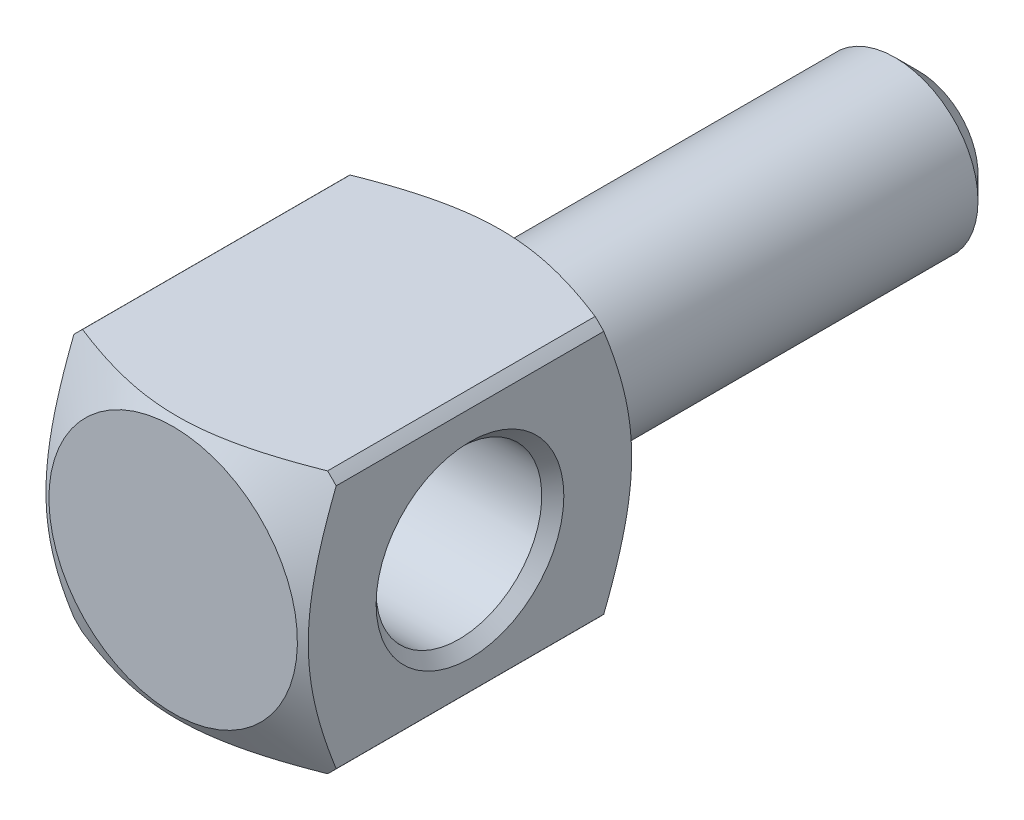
ISO-10303-21;
HEADER;
FILE_DESCRIPTION(('STEP AP214'),'2;1');
FILE_NAME('part.step','',(''),(''),'','','');
FILE_SCHEMA(('AUTOMOTIVE_DESIGN { 1 0 10303 214 1 1 1 1 }'));
ENDSEC;
DATA;
#1=APPLICATION_CONTEXT('core data for automotive mechanical design processes');
#2=APPLICATION_PROTOCOL_DEFINITION('international standard','automotive_design',2000,#1);
#3=PRODUCT_CONTEXT('',#1,'mechanical');
#4=PRODUCT('Part','Part','',(#3));
#5=PRODUCT_RELATED_PRODUCT_CATEGORY('part','',(#4));
#6=PRODUCT_DEFINITION_FORMATION('','',#4);
#7=PRODUCT_DEFINITION_CONTEXT('part definition',#1,'design');
#8=PRODUCT_DEFINITION('design','',#6,#7);
#9=PRODUCT_DEFINITION_SHAPE('','',#8);
#10=(LENGTH_UNIT() NAMED_UNIT(*) SI_UNIT(.MILLI.,.METRE.));
#11=(NAMED_UNIT(*) PLANE_ANGLE_UNIT() SI_UNIT($,.RADIAN.));
#12=(NAMED_UNIT(*) SI_UNIT($,.STERADIAN.) SOLID_ANGLE_UNIT());
#13=UNCERTAINTY_MEASURE_WITH_UNIT(LENGTH_MEASURE(1.E-05),#10,'distance_accuracy_value','');
#14=(GEOMETRIC_REPRESENTATION_CONTEXT(3) GLOBAL_UNCERTAINTY_ASSIGNED_CONTEXT((#13)) GLOBAL_UNIT_ASSIGNED_CONTEXT((#10,
#11,#12)) REPRESENTATION_CONTEXT('',''));
#15=CARTESIAN_POINT('',(0.,0.,0.));
#16=DIRECTION('',(0.,0.,1.));
#17=DIRECTION('',(1.,0.,0.));
#18=AXIS2_PLACEMENT_3D('',#15,#16,#17);
#19=CARTESIAN_POINT('',(9.5,9.5,30.));
#20=DIRECTION('',(0.,1.,0.));
#21=DIRECTION('',(-1.,0.,0.));
#22=AXIS2_PLACEMENT_3D('',#19,#20,#21);
#23=PLANE('',#22);
#24=DIRECTION('',(0.,0.,1.));
#25=VECTOR('',#24,1.);
#26=CARTESIAN_POINT('',(8.87411967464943,9.5,-30.));
#27=LINE('',#26,#25);
#28=CARTESIAN_POINT('',(8.87411967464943,9.5,51.6905989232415));
#29=VERTEX_POINT('',#28);
#30=CARTESIAN_POINT('',(8.87411967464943,9.5,32.3094010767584));
#31=VERTEX_POINT('',#30);
#32=EDGE_CURVE('E99',#29,#31,#27,.F.);
#33=ORIENTED_EDGE('',*,*,#32,.T.);
#34=CARTESIAN_POINT('',(-18.2224132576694,9.5,36.6684496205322));
#35=CARTESIAN_POINT('',(-17.769219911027,9.50000000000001,36.4364741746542));
#36=CARTESIAN_POINT('',(-17.3153006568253,9.50000000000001,36.2059019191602));
#37=CARTESIAN_POINT('',(-16.4056324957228,9.50000000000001,35.7483166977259));
#38=CARTESIAN_POINT('',(-15.9498834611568,9.50000000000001,35.5213039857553));
#39=CARTESIAN_POINT('',(-15.0350528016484,9.50000000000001,35.0710385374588));
#40=CARTESIAN_POINT('',(-14.5759655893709,9.50000000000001,34.8477971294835));
#41=CARTESIAN_POINT('',(-13.6551895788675,9.50000000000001,34.4067647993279));
#42=CARTESIAN_POINT('',(-13.1935008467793,9.50000000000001,34.1889737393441));
#43=CARTESIAN_POINT('',(-12.2421147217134,9.50000000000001,33.7487542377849));
#44=CARTESIAN_POINT('',(-11.7522423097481,9.50000000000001,33.5267027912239));
#45=CARTESIAN_POINT('',(-10.7681013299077,9.50000000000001,33.0924186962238));
#46=CARTESIAN_POINT('',(-10.2738324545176,9.50000000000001,32.8801867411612));
#47=CARTESIAN_POINT('',(-9.28039686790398,9.50000000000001,32.4688328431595));
#48=CARTESIAN_POINT('',(-8.78123530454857,9.50000000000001,32.2696985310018));
#49=CARTESIAN_POINT('',(-7.77642962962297,9.5,31.8885552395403));
#50=CARTESIAN_POINT('',(-7.27078668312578,9.5,31.7065432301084));
#51=CARTESIAN_POINT('',(-6.50923896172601,9.5,31.4516095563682));
#52=CARTESIAN_POINT('',(-6.25623291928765,9.5,31.3700334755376));
#53=CARTESIAN_POINT('',(-5.74823174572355,9.5,31.2133719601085));
#54=CARTESIAN_POINT('',(-5.49323662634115,9.5,31.1382864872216));
#55=CARTESIAN_POINT('',(-4.72506226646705,9.5,30.9241718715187));
#56=CARTESIAN_POINT('',(-4.20864637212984,9.5,30.7962682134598));
#57=CARTESIAN_POINT('',(-3.43286731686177,9.5,30.6341684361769));
#58=CARTESIAN_POINT('',(-3.17650468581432,9.5,30.5854189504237));
#59=CARTESIAN_POINT('',(-2.66205119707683,9.5,30.4981746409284));
#60=CARTESIAN_POINT('',(-2.40396055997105,9.5,30.4596785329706));
#61=CARTESIAN_POINT('',(-1.88637887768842,9.5,30.3938604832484));
#62=CARTESIAN_POINT('',(-1.62688799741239,9.5,30.3665372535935));
#63=CARTESIAN_POINT('',(-1.10691522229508,9.5,30.3237821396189));
#64=CARTESIAN_POINT('',(-0.84643329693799,9.5,30.3083506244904));
#65=CARTESIAN_POINT('',(-0.27807643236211,9.5,30.2881624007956));
#66=CARTESIAN_POINT('',(0.0298883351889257,9.5,30.28582759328));
#67=CARTESIAN_POINT('',(0.64546542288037,9.5,30.2984502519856));
#68=CARTESIAN_POINT('',(0.953077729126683,9.5,30.3134083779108));
#69=CARTESIAN_POINT('',(1.56709468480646,9.5,30.3600186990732));
#70=CARTESIAN_POINT('',(1.8734990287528,9.5,30.391674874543));
#71=CARTESIAN_POINT('',(2.48428854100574,9.5,30.470505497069));
#72=CARTESIAN_POINT('',(2.78867366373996,9.5,30.5176802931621));
#73=CARTESIAN_POINT('',(3.40285822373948,9.5,30.6274179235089));
#74=CARTESIAN_POINT('',(3.71259089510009,9.5,30.6903511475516));
#75=CARTESIAN_POINT('',(4.32913758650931,9.5,30.8290944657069));
#76=CARTESIAN_POINT('',(4.63595154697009,9.5,30.9049048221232));
#77=CARTESIAN_POINT('',(5.2467001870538,9.5,31.0676168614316));
#78=CARTESIAN_POINT('',(5.55063403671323,9.5,31.1545216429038));
#79=CARTESIAN_POINT('',(6.00436552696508,9.5,31.2919351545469));
#80=CARTESIAN_POINT('',(6.15524532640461,9.5,31.3389148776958));
#81=CARTESIAN_POINT('',(6.45631287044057,9.5,31.4350427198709));
#82=CARTESIAN_POINT('',(6.60650061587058,9.5,31.4841908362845));
#83=CARTESIAN_POINT('',(7.05046006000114,9.5,31.6327445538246));
#84=CARTESIAN_POINT('',(7.34328430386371,9.5,31.7349881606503));
#85=CARTESIAN_POINT('',(7.92659587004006,9.5,31.9459586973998));
#86=CARTESIAN_POINT('',(8.21708303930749,9.5,32.0546860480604));
#87=CARTESIAN_POINT('',(8.79600608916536,9.5,32.2776506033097));
#88=CARTESIAN_POINT('',(9.08444148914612,9.5,32.3918890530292));
#89=CARTESIAN_POINT('',(9.65942453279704,9.5,32.6250296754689));
#90=CARTESIAN_POINT('',(9.94597212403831,9.5,32.7439319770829));
#91=CARTESIAN_POINT('',(10.8036541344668,9.5,33.1067979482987));
#92=CARTESIAN_POINT('',(11.3722751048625,9.5,33.3567046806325));
#93=CARTESIAN_POINT('',(12.5041765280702,9.5,33.8680744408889));
#94=CARTESIAN_POINT('',(13.0674575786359,9.5,34.1295361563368));
#95=CARTESIAN_POINT('',(14.1918880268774,9.5,34.6621099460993));
#96=CARTESIAN_POINT('',(14.753022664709,9.5,34.9332531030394));
#97=CARTESIAN_POINT('',(15.8720132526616,9.5,35.4822356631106));
#98=CARTESIAN_POINT('',(16.4298691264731,9.5,35.7600752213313));
#99=CARTESIAN_POINT('',(17.5426384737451,9.5,36.3207985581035));
#100=CARTESIAN_POINT('',(18.0975534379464,9.5,36.6036793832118));
#101=CARTESIAN_POINT('',(19.2052581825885,9.5,37.1735541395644));
#102=CARTESIAN_POINT('',(19.7580479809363,9.5,37.4605480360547));
#103=CARTESIAN_POINT('',(21.2655947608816,9.5,38.2489310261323));
#104=CARTESIAN_POINT('',(22.2186351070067,9.5,38.7536011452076));
#105=CARTESIAN_POINT('',(24.1211673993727,9.5,39.7699333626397));
#106=CARTESIAN_POINT('',(25.0706587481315,9.49999999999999,40.2815965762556));
#107=CARTESIAN_POINT('',(26.9601886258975,9.49999999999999,41.3063480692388));
#108=CARTESIAN_POINT('',(27.9002465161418,9.49999999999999,41.8194006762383));
#109=CARTESIAN_POINT('',(29.3086994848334,9.49999999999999,42.5917502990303));
#110=CARTESIAN_POINT('',(29.7778684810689,9.49999999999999,42.8496381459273));
#111=CARTESIAN_POINT('',(30.7157490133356,9.49999999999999,43.3662426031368));
#112=CARTESIAN_POINT('',(31.1844605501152,9.5,43.6249592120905));
#113=CARTESIAN_POINT('',(31.6529732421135,9.5,43.8840355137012));
#114=B_SPLINE_CURVE_WITH_KNOTS('',3,(#34,#35,#36,#37,#38,#39,#40,#41,#42,#43,#44,#45,#46,#47,
#48,#49,#50,#51,#52,#53,#54,#55,#56,#57,#58,#59,#60,#61,#62,#63,#64,#65,#66,#67,#68,#69,#70,#71,
#72,#73,#74,#75,#76,#77,#78,#79,#80,#81,#82,#83,#84,#85,#86,#87,#88,#89,#90,#91,#92,#93,#94,#95,
#96,#97,#98,#99,#100,#101,#102,#103,#104,#105,#106,#107,#108,#109,#110,#111,#112,#113),
.UNSPECIFIED.,.F.,.F.,(4,2,2,2,2,2,2,2,2,2,2,2,2,2,2,2,2,2,2,2,2,2,2,2,2,2,2,2,2,2,2,2,2,2,2,2,
2,2,2,4),(0.,1.52734899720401,3.05480647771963,4.58624085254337,6.11763646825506,
7.73110291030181,9.34468310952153,10.9567169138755,12.5684648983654,13.3658794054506,
14.1632892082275,15.7579578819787,16.5406623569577,17.3232687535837,18.1057849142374,
18.8883253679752,19.8117450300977,20.7351999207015,21.658875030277,22.5825709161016,
23.5304394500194,24.4783272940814,25.4264804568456,25.9005413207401,26.3746016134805,
27.3049844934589,28.2354278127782,29.1660823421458,30.0967626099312,31.9599026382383,
33.8228315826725,35.692402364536,37.5620164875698,39.4305691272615,41.2991059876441,
44.534303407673,47.7700229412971,50.9828578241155,52.5889802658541,54.1951000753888),.UNSPECIFIED.);
#115=CARTESIAN_POINT('',(-8.87411967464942,9.5,32.3094010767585));
#116=VERTEX_POINT('',#115);
#117=EDGE_CURVE('E30',#31,#116,#114,.F.);
#118=ORIENTED_EDGE('',*,*,#117,.T.);
#119=DIRECTION('',(0.,0.,1.));
#120=VECTOR('',#119,1.);
#121=CARTESIAN_POINT('',(-8.87411967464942,9.5,-30.));
#122=LINE('',#121,#120);
#123=CARTESIAN_POINT('',(-8.87411967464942,9.5,51.6905989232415));
#124=VERTEX_POINT('',#123);
#125=EDGE_CURVE('E228',#116,#124,#122,.T.);
#126=ORIENTED_EDGE('',*,*,#125,.T.);
#127=CARTESIAN_POINT('',(-18.2224132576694,9.5,47.3315503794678));
#128=CARTESIAN_POINT('',(-17.769219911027,9.50000000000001,47.5635258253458));
#129=CARTESIAN_POINT('',(-17.3153006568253,9.50000000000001,47.7940980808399));
#130=CARTESIAN_POINT('',(-16.4056324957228,9.50000000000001,48.2516833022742));
#131=CARTESIAN_POINT('',(-15.9498834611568,9.50000000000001,48.4786960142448));
#132=CARTESIAN_POINT('',(-15.0350528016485,9.50000000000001,48.9289614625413));
#133=CARTESIAN_POINT('',(-14.575965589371,9.50000000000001,49.1522028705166));
#134=CARTESIAN_POINT('',(-13.6551895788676,9.50000000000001,49.5932352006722));
#135=CARTESIAN_POINT('',(-13.1935008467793,9.50000000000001,49.811026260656));
#136=CARTESIAN_POINT('',(-12.2421147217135,9.50000000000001,50.2512457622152));
#137=CARTESIAN_POINT('',(-11.7522423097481,9.50000000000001,50.4732972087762));
#138=CARTESIAN_POINT('',(-10.7681013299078,9.50000000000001,50.9075813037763));
#139=CARTESIAN_POINT('',(-10.2738324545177,9.50000000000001,51.1198132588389));
#140=CARTESIAN_POINT('',(-9.28039686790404,9.50000000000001,51.5311671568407));
#141=CARTESIAN_POINT('',(-8.78123530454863,9.50000000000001,51.7303014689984));
#142=CARTESIAN_POINT('',(-7.77642962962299,9.5,52.1114447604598));
#143=CARTESIAN_POINT('',(-7.27078668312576,9.5,52.2934567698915));
#144=CARTESIAN_POINT('',(-6.50923896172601,9.5,52.5483904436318));
#145=CARTESIAN_POINT('',(-6.25623291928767,9.5,52.6299665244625));
#146=CARTESIAN_POINT('',(-5.74823174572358,9.5,52.7866280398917));
#147=CARTESIAN_POINT('',(-5.49323662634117,9.5,52.8617135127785));
#148=CARTESIAN_POINT('',(-4.72506226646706,9.5,53.0758281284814));
#149=CARTESIAN_POINT('',(-4.20864637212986,9.5,53.2037317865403));
#150=CARTESIAN_POINT('',(-3.43286731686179,9.5,53.3658315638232));
#151=CARTESIAN_POINT('',(-3.17650468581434,9.5,53.4145810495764));
#152=CARTESIAN_POINT('',(-2.66205119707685,9.5,53.5018253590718));
#153=CARTESIAN_POINT('',(-2.40396055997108,9.5,53.5403214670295));
#154=CARTESIAN_POINT('',(-1.88637887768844,9.5,53.6061395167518));
#155=CARTESIAN_POINT('',(-1.62688799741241,9.5,53.6334627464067));
#156=CARTESIAN_POINT('',(-1.10691522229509,9.5,53.6762178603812));
#157=CARTESIAN_POINT('',(-0.846433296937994,9.5,53.6916493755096));
#158=CARTESIAN_POINT('',(-0.278076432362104,9.5,53.7118375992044));
#159=CARTESIAN_POINT('',(0.0298883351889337,9.5,53.7141724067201));
#160=CARTESIAN_POINT('',(0.645465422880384,9.5,53.7015497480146));
#161=CARTESIAN_POINT('',(0.9530777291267,9.5,53.6865916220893));
#162=CARTESIAN_POINT('',(1.56709468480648,9.5,53.6399813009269));
#163=CARTESIAN_POINT('',(1.87349902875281,9.5,53.6083251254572));
#164=CARTESIAN_POINT('',(2.48428854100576,9.5,53.5294945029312));
#165=CARTESIAN_POINT('',(2.78867366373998,9.5,53.482319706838));
#166=CARTESIAN_POINT('',(3.4028582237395,9.5,53.3725820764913));
#167=CARTESIAN_POINT('',(3.71259089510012,9.5,53.3096488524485));
#168=CARTESIAN_POINT('',(4.32913758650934,9.5,53.1709055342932));
#169=CARTESIAN_POINT('',(4.63595154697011,9.5,53.0950951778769));
#170=CARTESIAN_POINT('',(5.24670018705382,9.5,52.9323831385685));
#171=CARTESIAN_POINT('',(5.55063403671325,9.5,52.8454783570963));
#172=CARTESIAN_POINT('',(6.00436552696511,9.5,52.7080648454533));
#173=CARTESIAN_POINT('',(6.15524532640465,9.5,52.6610851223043));
#174=CARTESIAN_POINT('',(6.45631287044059,9.5,52.5649572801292));
#175=CARTESIAN_POINT('',(6.60650061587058,9.5,52.5158091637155));
#176=CARTESIAN_POINT('',(7.05046006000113,9.5,52.3672554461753));
#177=CARTESIAN_POINT('',(7.34328430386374,9.5,52.2650118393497));
#178=CARTESIAN_POINT('',(7.92659587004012,9.5,52.0540413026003));
#179=CARTESIAN_POINT('',(8.21708303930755,9.5,51.9453139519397));
#180=CARTESIAN_POINT('',(8.79600608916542,9.5,51.7223493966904));
#181=CARTESIAN_POINT('',(9.08444148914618,9.5,51.6081109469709));
#182=CARTESIAN_POINT('',(9.65942453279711,9.5,51.3749703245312));
#183=CARTESIAN_POINT('',(9.94597212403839,9.5,51.2560680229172));
#184=CARTESIAN_POINT('',(10.8036541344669,9.5,50.8932020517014));
#185=CARTESIAN_POINT('',(11.3722751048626,9.5,50.6432953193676));
#186=CARTESIAN_POINT('',(12.5041765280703,9.5,50.1319255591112));
#187=CARTESIAN_POINT('',(13.067457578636,9.5,49.8704638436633));
#188=CARTESIAN_POINT('',(14.1918880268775,9.5,49.3378900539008));
#189=CARTESIAN_POINT('',(14.7530226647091,9.5,49.0667468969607));
#190=CARTESIAN_POINT('',(15.8720132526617,9.5,48.5177643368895));
#191=CARTESIAN_POINT('',(16.4298691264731,9.5,48.2399247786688));
#192=CARTESIAN_POINT('',(17.5426384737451,9.5,47.6792014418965));
#193=CARTESIAN_POINT('',(18.0975534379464,9.5,47.3963206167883));
#194=CARTESIAN_POINT('',(19.2052581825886,9.5,46.8264458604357));
#195=CARTESIAN_POINT('',(19.7580479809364,9.5,46.5394519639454));
#196=CARTESIAN_POINT('',(21.2655947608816,9.5,45.7510689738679));
#197=CARTESIAN_POINT('',(22.2186351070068,9.5,45.2463988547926));
#198=CARTESIAN_POINT('',(24.1211673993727,9.5,44.2300666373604));
#199=CARTESIAN_POINT('',(25.0706587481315,9.49999999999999,43.7184034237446));
#200=CARTESIAN_POINT('',(26.9601886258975,9.49999999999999,42.6936519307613));
#201=CARTESIAN_POINT('',(27.9002465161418,9.49999999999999,42.1805993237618));
#202=CARTESIAN_POINT('',(29.3086994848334,9.49999999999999,41.4082497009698));
#203=CARTESIAN_POINT('',(29.777868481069,9.49999999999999,41.1503618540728));
#204=CARTESIAN_POINT('',(30.7157490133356,9.49999999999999,40.6337573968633));
#205=CARTESIAN_POINT('',(31.1844605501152,9.5,40.3750407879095));
#206=CARTESIAN_POINT('',(31.6529732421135,9.5,40.1159644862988));
#207=B_SPLINE_CURVE_WITH_KNOTS('',3,(#127,#128,#129,#130,#131,#132,#133,#134,#135,#136,#137,
#138,#139,#140,#141,#142,#143,#144,#145,#146,#147,#148,#149,#150,#151,#152,#153,#154,#155,#156,
#157,#158,#159,#160,#161,#162,#163,#164,#165,#166,#167,#168,#169,#170,#171,#172,#173,#174,#175,
#176,#177,#178,#179,#180,#181,#182,#183,#184,#185,#186,#187,#188,#189,#190,#191,#192,#193,#194,
#195,#196,#197,#198,#199,#200,#201,#202,#203,#204,#205,#206),.UNSPECIFIED.,.F.,.F.,(4,2,2,2,2,2,
2,2,2,2,2,2,2,2,2,2,2,2,2,2,2,2,2,2,2,2,2,2,2,2,2,2,2,2,2,2,2,2,2,4),(0.,1.52734899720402,
3.05480647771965,4.58624085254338,6.11763646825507,7.73110291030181,9.34468310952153,
10.9567169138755,12.5684648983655,13.3658794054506,14.1632892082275,15.7579578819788,
16.5406623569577,17.3232687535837,18.1057849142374,18.8883253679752,19.8117450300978,
20.7351999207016,21.658875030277,22.5825709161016,23.5304394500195,24.4783272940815,
25.4264804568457,25.9005413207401,26.3746016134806,27.304984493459,28.2354278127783,
29.166082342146,30.0967626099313,31.9599026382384,33.8228315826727,35.6924023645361,
37.5620164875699,39.4305691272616,41.2991059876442,44.5343034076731,47.7700229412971,
50.9828578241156,52.5889802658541,54.1951000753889),.UNSPECIFIED.);
#208=EDGE_CURVE('E156',#124,#29,#207,.T.);
#209=ORIENTED_EDGE('',*,*,#208,.T.);
#210=EDGE_LOOP('',(#33,#118,#126,#209));
#211=FACE_BOUND('',#210,.T.);
#212=ADVANCED_FACE('F14',(#211),#23,.T.);
#213=CARTESIAN_POINT('',(9.5,9.5,30.));
#214=DIRECTION('',(-1.,0.,0.));
#215=DIRECTION('',(0.,0.,-1.));
#216=AXIS2_PLACEMENT_3D('',#213,#214,#215);
#217=PLANE('',#216);
#218=CARTESIAN_POINT('',(9.5,0.,42.));
#219=DIRECTION('',(-1.,0.,0.));
#220=DIRECTION('',(0.,0.,-1.));
#221=AXIS2_PLACEMENT_3D('',#218,#219,#220);
#222=CIRCLE('',#221,6.8);
#223=CARTESIAN_POINT('',(9.5,0.,35.2));
#224=VERTEX_POINT('',#223);
#225=EDGE_CURVE('E110',#224,#224,#222,.T.);
#226=ORIENTED_EDGE('',*,*,#225,.T.);
#227=EDGE_LOOP('',(#226));
#228=FACE_BOUND('',#227,.T.);
#229=CARTESIAN_POINT('',(9.5,18.2224132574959,36.6684496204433));
#230=CARTESIAN_POINT('',(9.5,17.7692199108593,36.4364741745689));
#231=CARTESIAN_POINT('',(9.5,17.3153006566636,36.2059019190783));
#232=CARTESIAN_POINT('',(9.5,16.405632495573,35.7483166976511));
#233=CARTESIAN_POINT('',(9.5,15.949883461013,35.521303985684));
#234=CARTESIAN_POINT('',(9.5,15.0350528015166,35.0710385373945));
#235=CARTESIAN_POINT('',(9.5,14.5759655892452,34.8477971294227));
#236=CARTESIAN_POINT('',(9.5,13.6551895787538,34.406764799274));
#237=CARTESIAN_POINT('',(9.5,13.1935008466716,34.1889737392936));
#238=CARTESIAN_POINT('',(9.5,12.2421147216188,33.7487542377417));
#239=CARTESIAN_POINT('',(9.5,11.7522423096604,33.5267027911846));
#240=CARTESIAN_POINT('',(9.5,10.7681013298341,33.092418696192));
#241=CARTESIAN_POINT('',(9.5,10.273832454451,32.880186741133));
#242=CARTESIAN_POINT('',(9.5,9.28039686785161,32.4688328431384));
#243=CARTESIAN_POINT('',(9.5,8.78123530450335,32.2696985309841));
#244=CARTESIAN_POINT('',(9.5,7.77642962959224,31.8885552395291));
#245=CARTESIAN_POINT('',(9.5,7.27078668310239,31.7065432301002));
#246=CARTESIAN_POINT('',(9.5,6.50923896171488,31.4516095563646));
#247=CARTESIAN_POINT('',(9.5,6.25623291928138,31.3700334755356));
#248=CARTESIAN_POINT('',(9.5,5.7482317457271,31.2133719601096));
#249=CARTESIAN_POINT('',(9.5,5.49323662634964,31.1382864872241));
#250=CARTESIAN_POINT('',(9.5,4.72506226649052,30.924171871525));
#251=CARTESIAN_POINT('',(9.5,4.20864637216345,30.7962682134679));
#252=CARTESIAN_POINT('',(9.5,3.43286731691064,30.6341684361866));
#253=CARTESIAN_POINT('',(9.5,3.17650468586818,30.5854189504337));
#254=CARTESIAN_POINT('',(9.5,2.66205119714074,30.4981746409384));
#255=CARTESIAN_POINT('',(9.5,2.40396056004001,30.4596785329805));
#256=CARTESIAN_POINT('',(9.5,1.88637887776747,30.3938604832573));
#257=CARTESIAN_POINT('',(9.5,1.6268879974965,30.3665372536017));
#258=CARTESIAN_POINT('',(9.5,1.10691522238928,30.3237821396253));
#259=CARTESIAN_POINT('',(9.5,0.846433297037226,30.3083506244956));
#260=CARTESIAN_POINT('',(9.5,0.278076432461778,30.2881624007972));
#261=CARTESIAN_POINT('',(9.5,-0.0298883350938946,30.2858275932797));
#262=CARTESIAN_POINT('',(9.5,-0.645465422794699,30.2984502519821));
#263=CARTESIAN_POINT('',(9.5,-0.953077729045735,30.313408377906));
#264=CARTESIAN_POINT('',(9.5,-1.56709468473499,30.3600186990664));
#265=CARTESIAN_POINT('',(9.5,-1.87349902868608,30.3916748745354));
#266=CARTESIAN_POINT('',(9.5,-2.48428854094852,30.4705054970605));
#267=CARTESIAN_POINT('',(9.5,-2.78867366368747,30.5176802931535));
#268=CARTESIAN_POINT('',(9.5,-3.40285822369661,30.6274179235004));
#269=CARTESIAN_POINT('',(9.5,-3.7125908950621,30.6903511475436));
#270=CARTESIAN_POINT('',(9.5,-4.32913758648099,30.8290944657));
#271=CARTESIAN_POINT('',(9.5,-4.63595154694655,30.9049048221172));
#272=CARTESIAN_POINT('',(9.5,-5.24670018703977,31.0676168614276));
#273=CARTESIAN_POINT('',(9.5,-5.55063403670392,31.154521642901));
#274=CARTESIAN_POINT('',(9.5,-6.00436552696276,31.2919351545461));
#275=CARTESIAN_POINT('',(9.5,-6.15524532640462,31.3389148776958));
#276=CARTESIAN_POINT('',(9.5,-6.4563128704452,31.4350427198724));
#277=CARTESIAN_POINT('',(9.5,-6.60650061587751,31.4841908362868));
#278=CARTESIAN_POINT('',(9.5,-7.05046006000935,31.6327445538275));
#279=CARTESIAN_POINT('',(9.5,-7.34328430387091,31.7349881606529));
#280=CARTESIAN_POINT('',(9.5,-7.92659587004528,31.9459586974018));
#281=CARTESIAN_POINT('',(9.5,-8.21708303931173,32.054686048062));
#282=CARTESIAN_POINT('',(9.5,-8.79600608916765,32.2776506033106));
#283=CARTESIAN_POINT('',(9.5,-9.08444148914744,32.3918890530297));
#284=CARTESIAN_POINT('',(9.5,-9.65942453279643,32.6250296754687));
#285=CARTESIAN_POINT('',(9.5,-9.94597212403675,32.7439319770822));
#286=CARTESIAN_POINT('',(9.5,-10.8036541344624,33.1067979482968));
#287=CARTESIAN_POINT('',(9.5,-11.3722751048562,33.3567046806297));
#288=CARTESIAN_POINT('',(9.5,-12.5041765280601,33.8680744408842));
#289=CARTESIAN_POINT('',(9.5,-13.0674575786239,34.1295361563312));
#290=CARTESIAN_POINT('',(9.5,-14.1918880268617,34.6621099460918));
#291=CARTESIAN_POINT('',(9.5,-14.7530226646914,34.9332531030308));
#292=CARTESIAN_POINT('',(9.5,-15.8720132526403,35.4822356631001));
#293=CARTESIAN_POINT('',(9.5,-16.4298691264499,35.7600752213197));
#294=CARTESIAN_POINT('',(9.5,-17.5426384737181,36.3207985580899));
#295=CARTESIAN_POINT('',(9.5,-18.0975534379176,36.6036793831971));
#296=CARTESIAN_POINT('',(9.5,-19.205258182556,37.1735541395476));
#297=CARTESIAN_POINT('',(9.5,-19.7580479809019,37.4605480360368));
#298=CARTESIAN_POINT('',(9.5,-21.2655947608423,38.2489310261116));
#299=CARTESIAN_POINT('',(9.5,-22.2186351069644,38.7536011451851));
#300=CARTESIAN_POINT('',(9.5,-24.1211673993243,39.7699333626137));
#301=CARTESIAN_POINT('',(9.5,-25.07065874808,40.2815965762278));
#302=CARTESIAN_POINT('',(9.5,-26.96018862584,41.3063480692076));
#303=CARTESIAN_POINT('',(9.5,-27.9002465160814,41.8194006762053));
#304=CARTESIAN_POINT('',(9.5,-29.3086994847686,42.5917502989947));
#305=CARTESIAN_POINT('',(9.5,-29.7778684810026,42.8496381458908));
#306=CARTESIAN_POINT('',(9.5,-30.7157490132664,43.3662426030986));
#307=CARTESIAN_POINT('',(9.5,-31.1844605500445,43.6249592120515));
#308=CARTESIAN_POINT('',(9.5,-31.6529732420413,43.8840355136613));
#309=B_SPLINE_CURVE_WITH_KNOTS('',3,(#229,#230,#231,#232,#233,#234,#235,#236,#237,#238,#239,
#240,#241,#242,#243,#244,#245,#246,#247,#248,#249,#250,#251,#252,#253,#254,#255,#256,#257,#258,
#259,#260,#261,#262,#263,#264,#265,#266,#267,#268,#269,#270,#271,#272,#273,#274,#275,#276,#277,
#278,#279,#280,#281,#282,#283,#284,#285,#286,#287,#288,#289,#290,#291,#292,#293,#294,#295,#296,
#297,#298,#299,#300,#301,#302,#303,#304,#305,#306,#307,#308),.UNSPECIFIED.,.F.,.F.,(4,2,2,2,2,2,
2,2,2,2,2,2,2,2,2,2,2,2,2,2,2,2,2,2,2,2,2,2,2,2,2,2,2,2,2,2,2,2,2,4),(0.,1.52734899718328,
3.05480647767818,4.5862408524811,6.11763646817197,7.73110291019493,9.34468310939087,
10.9567169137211,12.5684648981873,13.365879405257,14.1632892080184,15.7579578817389,
16.540662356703,17.3232687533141,18.1057849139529,18.8883253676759,19.8117450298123,
20.7351999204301,21.6588750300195,22.582570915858,23.5304394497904,24.4783272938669,
25.4264804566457,25.9005413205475,26.3746016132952,27.3049844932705,28.2354278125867,
29.1660823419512,30.0967626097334,31.9599026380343,33.8228315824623,35.6924023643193,
37.5620164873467,39.430569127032,41.2991059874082,44.5343034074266,47.77002294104,
50.9828578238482,52.5889802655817,54.1951000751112),.UNSPECIFIED.);
#310=CARTESIAN_POINT('',(9.5,8.87411967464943,32.3094010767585));
#311=VERTEX_POINT('',#310);
#312=CARTESIAN_POINT('',(9.5,-8.87411967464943,32.3094010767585));
#313=VERTEX_POINT('',#312);
#314=EDGE_CURVE('E82',#311,#313,#309,.T.);
#315=ORIENTED_EDGE('',*,*,#314,.F.);
#316=DIRECTION('',(0.,0.,1.));
#317=VECTOR('',#316,1.);
#318=CARTESIAN_POINT('',(9.5,8.87411967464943,-30.));
#319=LINE('',#318,#317);
#320=CARTESIAN_POINT('',(9.5,8.87411967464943,51.6905989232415));
#321=VERTEX_POINT('',#320);
#322=EDGE_CURVE('E94',#321,#311,#319,.F.);
#323=ORIENTED_EDGE('',*,*,#322,.F.);
#324=CARTESIAN_POINT('',(9.5,18.2224132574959,47.3315503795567));
#325=CARTESIAN_POINT('',(9.5,17.7692199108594,47.5635258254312));
#326=CARTESIAN_POINT('',(9.5,17.3153006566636,47.7940980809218));
#327=CARTESIAN_POINT('',(9.5,16.4056324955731,48.251683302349));
#328=CARTESIAN_POINT('',(9.5,15.9498834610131,48.4786960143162));
#329=CARTESIAN_POINT('',(9.5,15.0350528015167,48.9289614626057));
#330=CARTESIAN_POINT('',(9.5,14.5759655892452,49.1522028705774));
#331=CARTESIAN_POINT('',(9.5,13.6551895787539,49.5932352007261));
#332=CARTESIAN_POINT('',(9.5,13.1935008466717,49.8110262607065));
#333=CARTESIAN_POINT('',(9.5,12.2421147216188,50.2512457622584));
#334=CARTESIAN_POINT('',(9.5,11.7522423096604,50.4732972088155));
#335=CARTESIAN_POINT('',(9.5,10.7681013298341,50.9075813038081));
#336=CARTESIAN_POINT('',(9.5,10.2738324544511,51.1198132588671));
#337=CARTESIAN_POINT('',(9.5,9.28039686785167,51.5311671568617));
#338=CARTESIAN_POINT('',(9.5,8.78123530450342,51.730301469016));
#339=CARTESIAN_POINT('',(9.5,7.77642962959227,52.111444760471));
#340=CARTESIAN_POINT('',(9.5,7.27078668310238,52.2934567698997));
#341=CARTESIAN_POINT('',(9.5,6.50923896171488,52.5483904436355));
#342=CARTESIAN_POINT('',(9.5,6.25623291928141,52.6299665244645));
#343=CARTESIAN_POINT('',(9.5,5.74823174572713,52.7866280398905));
#344=CARTESIAN_POINT('',(9.5,5.49323662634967,52.861713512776));
#345=CARTESIAN_POINT('',(9.5,4.72506226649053,53.0758281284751));
#346=CARTESIAN_POINT('',(9.5,4.20864637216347,53.2037317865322));
#347=CARTESIAN_POINT('',(9.5,3.43286731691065,53.3658315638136));
#348=CARTESIAN_POINT('',(9.5,3.1765046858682,53.4145810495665));
#349=CARTESIAN_POINT('',(9.5,2.66205119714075,53.5018253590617));
#350=CARTESIAN_POINT('',(9.5,2.40396056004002,53.5403214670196));
#351=CARTESIAN_POINT('',(9.5,1.88637887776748,53.6061395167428));
#352=CARTESIAN_POINT('',(9.5,1.62688799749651,53.6334627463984));
#353=CARTESIAN_POINT('',(9.5,1.10691522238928,53.6762178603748));
#354=CARTESIAN_POINT('',(9.5,0.84643329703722,53.6916493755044));
#355=CARTESIAN_POINT('',(9.5,0.27807643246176,53.7118375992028));
#356=CARTESIAN_POINT('',(9.5,-0.0298883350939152,53.7141724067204));
#357=CARTESIAN_POINT('',(9.5,-0.645465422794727,53.701549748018));
#358=CARTESIAN_POINT('',(9.5,-0.953077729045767,53.6865916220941));
#359=CARTESIAN_POINT('',(9.5,-1.56709468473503,53.6399813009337));
#360=CARTESIAN_POINT('',(9.5,-1.87349902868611,53.6083251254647));
#361=CARTESIAN_POINT('',(9.5,-2.48428854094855,53.5294945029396));
#362=CARTESIAN_POINT('',(9.5,-2.7886736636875,53.4823197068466));
#363=CARTESIAN_POINT('',(9.5,-3.40285822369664,53.3725820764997));
#364=CARTESIAN_POINT('',(9.5,-3.71259089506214,53.3096488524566));
#365=CARTESIAN_POINT('',(9.5,-4.32913758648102,53.1709055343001));
#366=CARTESIAN_POINT('',(9.5,-4.63595154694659,53.095095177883));
#367=CARTESIAN_POINT('',(9.5,-5.2467001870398,52.9323831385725));
#368=CARTESIAN_POINT('',(9.5,-5.55063403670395,52.8454783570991));
#369=CARTESIAN_POINT('',(9.5,-6.00436552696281,52.708064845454));
#370=CARTESIAN_POINT('',(9.5,-6.15524532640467,52.6610851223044));
#371=CARTESIAN_POINT('',(9.5,-6.45631287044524,52.5649572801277));
#372=CARTESIAN_POINT('',(9.5,-6.60650061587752,52.5158091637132));
#373=CARTESIAN_POINT('',(9.5,-7.05046006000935,52.3672554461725));
#374=CARTESIAN_POINT('',(9.5,-7.34328430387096,52.2650118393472));
#375=CARTESIAN_POINT('',(9.5,-7.92659587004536,52.0540413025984));
#376=CARTESIAN_POINT('',(9.5,-8.21708303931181,51.9453139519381));
#377=CARTESIAN_POINT('',(9.5,-8.79600608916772,51.7223493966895));
#378=CARTESIAN_POINT('',(9.5,-9.08444148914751,51.6081109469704));
#379=CARTESIAN_POINT('',(9.5,-9.65942453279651,51.3749703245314));
#380=CARTESIAN_POINT('',(9.5,-9.94597212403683,51.2560680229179));
#381=CARTESIAN_POINT('',(9.5,-10.8036541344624,50.8932020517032));
#382=CARTESIAN_POINT('',(9.5,-11.3722751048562,50.6432953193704));
#383=CARTESIAN_POINT('',(9.5,-12.5041765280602,50.1319255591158));
#384=CARTESIAN_POINT('',(9.5,-13.067457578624,49.8704638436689));
#385=CARTESIAN_POINT('',(9.5,-14.1918880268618,49.3378900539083));
#386=CARTESIAN_POINT('',(9.5,-14.7530226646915,49.0667468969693));
#387=CARTESIAN_POINT('',(9.5,-15.8720132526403,48.5177643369));
#388=CARTESIAN_POINT('',(9.5,-16.4298691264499,48.2399247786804));
#389=CARTESIAN_POINT('',(9.5,-17.5426384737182,47.6792014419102));
#390=CARTESIAN_POINT('',(9.5,-18.0975534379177,47.396320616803));
#391=CARTESIAN_POINT('',(9.5,-19.2052581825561,46.8264458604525));
#392=CARTESIAN_POINT('',(9.5,-19.758047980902,46.5394519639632));
#393=CARTESIAN_POINT('',(9.5,-21.2655947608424,45.7510689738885));
#394=CARTESIAN_POINT('',(9.5,-22.2186351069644,45.246398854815));
#395=CARTESIAN_POINT('',(9.5,-24.1211673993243,44.2300666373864));
#396=CARTESIAN_POINT('',(9.5,-25.07065874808,43.7184034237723));
#397=CARTESIAN_POINT('',(9.5,-26.96018862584,42.6936519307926));
#398=CARTESIAN_POINT('',(9.5,-27.9002465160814,42.1805993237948));
#399=CARTESIAN_POINT('',(9.5,-29.3086994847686,41.4082497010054));
#400=CARTESIAN_POINT('',(9.5,-29.7778684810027,41.1503618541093));
#401=CARTESIAN_POINT('',(9.5,-30.7157490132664,40.6337573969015));
#402=CARTESIAN_POINT('',(9.5,-31.1844605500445,40.3750407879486));
#403=CARTESIAN_POINT('',(9.5,-31.6529732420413,40.1159644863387));
#404=B_SPLINE_CURVE_WITH_KNOTS('',3,(#324,#325,#326,#327,#328,#329,#330,#331,#332,#333,#334,
#335,#336,#337,#338,#339,#340,#341,#342,#343,#344,#345,#346,#347,#348,#349,#350,#351,#352,#353,
#354,#355,#356,#357,#358,#359,#360,#361,#362,#363,#364,#365,#366,#367,#368,#369,#370,#371,#372,
#373,#374,#375,#376,#377,#378,#379,#380,#381,#382,#383,#384,#385,#386,#387,#388,#389,#390,#391,
#392,#393,#394,#395,#396,#397,#398,#399,#400,#401,#402,#403),.UNSPECIFIED.,.F.,.F.,(4,2,2,2,2,2,
2,2,2,2,2,2,2,2,2,2,2,2,2,2,2,2,2,2,2,2,2,2,2,2,2,2,2,2,2,2,2,2,2,4),(0.,1.5273489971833,
3.05480647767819,4.58624085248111,6.11763646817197,7.73110291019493,9.34468310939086,
10.9567169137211,12.5684648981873,13.365879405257,14.1632892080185,15.7579578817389,
16.540662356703,17.3232687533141,18.105784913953,18.8883253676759,19.8117450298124,
20.7351999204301,21.6588750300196,22.5825709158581,23.5304394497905,24.478327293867,
25.4264804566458,25.9005413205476,26.3746016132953,27.3049844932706,28.2354278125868,
29.1660823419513,30.0967626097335,31.9599026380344,33.8228315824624,35.6924023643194,
37.5620164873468,39.4305691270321,41.2991059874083,44.5343034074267,47.7700229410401,
50.9828578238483,52.5889802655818,54.1951000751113),.UNSPECIFIED.);
#405=CARTESIAN_POINT('',(9.5,-8.87411967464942,51.6905989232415));
#406=VERTEX_POINT('',#405);
#407=EDGE_CURVE('E38',#406,#321,#404,.F.);
#408=ORIENTED_EDGE('',*,*,#407,.F.);
#409=DIRECTION('',(0.,0.,1.));
#410=VECTOR('',#409,1.);
#411=CARTESIAN_POINT('',(9.5,-8.87411967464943,-30.));
#412=LINE('',#411,#410);
#413=EDGE_CURVE('E95',#313,#406,#412,.T.);
#414=ORIENTED_EDGE('',*,*,#413,.F.);
#415=EDGE_LOOP('',(#315,#323,#408,#414));
#416=FACE_BOUND('',#415,.T.);
#417=ADVANCED_FACE('F93',(#228,#416),#217,.F.);
#418=CARTESIAN_POINT('',(9.5,-9.5,30.));
#419=DIRECTION('',(0.,1.,0.));
#420=DIRECTION('',(-1.,0.,0.));
#421=AXIS2_PLACEMENT_3D('',#418,#419,#420);
#422=PLANE('',#421);
#423=CARTESIAN_POINT('',(-18.2224132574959,-9.5,36.6684496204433));
#424=CARTESIAN_POINT('',(-17.7692199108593,-9.5,36.4364741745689));
#425=CARTESIAN_POINT('',(-17.3153006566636,-9.5,36.2059019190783));
#426=CARTESIAN_POINT('',(-16.405632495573,-9.5,35.7483166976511));
#427=CARTESIAN_POINT('',(-15.949883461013,-9.5,35.521303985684));
#428=CARTESIAN_POINT('',(-15.0350528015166,-9.5,35.0710385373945));
#429=CARTESIAN_POINT('',(-14.5759655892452,-9.5,34.8477971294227));
#430=CARTESIAN_POINT('',(-13.6551895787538,-9.5,34.406764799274));
#431=CARTESIAN_POINT('',(-13.1935008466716,-9.5,34.1889737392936));
#432=CARTESIAN_POINT('',(-12.2421147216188,-9.5,33.7487542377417));
#433=CARTESIAN_POINT('',(-11.7522423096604,-9.5,33.5267027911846));
#434=CARTESIAN_POINT('',(-10.7681013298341,-9.5,33.092418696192));
#435=CARTESIAN_POINT('',(-10.2738324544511,-9.5,32.880186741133));
#436=CARTESIAN_POINT('',(-9.28039686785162,-9.5,32.4688328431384));
#437=CARTESIAN_POINT('',(-8.78123530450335,-9.5,32.2696985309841));
#438=CARTESIAN_POINT('',(-7.77642962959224,-9.5,31.8885552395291));
#439=CARTESIAN_POINT('',(-7.27078668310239,-9.5,31.7065432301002));
#440=CARTESIAN_POINT('',(-6.50923896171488,-9.5,31.4516095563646));
#441=CARTESIAN_POINT('',(-6.25623291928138,-9.5,31.3700334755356));
#442=CARTESIAN_POINT('',(-5.7482317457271,-9.5,31.2133719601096));
#443=CARTESIAN_POINT('',(-5.49323662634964,-9.5,31.1382864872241));
#444=CARTESIAN_POINT('',(-4.72506226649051,-9.5,30.924171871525));
#445=CARTESIAN_POINT('',(-4.20864637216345,-9.5,30.7962682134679));
#446=CARTESIAN_POINT('',(-3.43286731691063,-9.5,30.6341684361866));
#447=CARTESIAN_POINT('',(-3.17650468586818,-9.5,30.5854189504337));
#448=CARTESIAN_POINT('',(-2.66205119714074,-9.5,30.4981746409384));
#449=CARTESIAN_POINT('',(-2.40396056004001,-9.5,30.4596785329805));
#450=CARTESIAN_POINT('',(-1.88637887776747,-9.5,30.3938604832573));
#451=CARTESIAN_POINT('',(-1.6268879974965,-9.5,30.3665372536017));
#452=CARTESIAN_POINT('',(-1.10691522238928,-9.5,30.3237821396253));
#453=CARTESIAN_POINT('',(-0.846433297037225,-9.5,30.3083506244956));
#454=CARTESIAN_POINT('',(-0.278076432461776,-9.5,30.2881624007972));
#455=CARTESIAN_POINT('',(0.0298883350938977,-9.5,30.2858275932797));
#456=CARTESIAN_POINT('',(0.645465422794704,-9.5,30.2984502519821));
#457=CARTESIAN_POINT('',(0.953077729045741,-9.5,30.313408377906));
#458=CARTESIAN_POINT('',(1.567094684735,-9.5,30.3600186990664));
#459=CARTESIAN_POINT('',(1.87349902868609,-9.5,30.3916748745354));
#460=CARTESIAN_POINT('',(2.48428854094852,-9.5,30.4705054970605));
#461=CARTESIAN_POINT('',(2.78867366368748,-9.5,30.5176802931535));
#462=CARTESIAN_POINT('',(3.40285822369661,-9.5,30.6274179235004));
#463=CARTESIAN_POINT('',(3.71259089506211,-9.5,30.6903511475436));
#464=CARTESIAN_POINT('',(4.32913758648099,-9.5,30.8290944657));
#465=CARTESIAN_POINT('',(4.63595154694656,-9.5,30.9049048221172));
#466=CARTESIAN_POINT('',(5.24670018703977,-9.5,31.0676168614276));
#467=CARTESIAN_POINT('',(5.55063403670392,-9.5,31.154521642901));
#468=CARTESIAN_POINT('',(6.00436552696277,-9.5,31.2919351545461));
#469=CARTESIAN_POINT('',(6.15524532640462,-9.5,31.3389148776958));
#470=CARTESIAN_POINT('',(6.45631287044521,-9.5,31.4350427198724));
#471=CARTESIAN_POINT('',(6.60650061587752,-9.5,31.4841908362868));
#472=CARTESIAN_POINT('',(7.05046006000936,-9.5,31.6327445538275));
#473=CARTESIAN_POINT('',(7.34328430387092,-9.5,31.7349881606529));
#474=CARTESIAN_POINT('',(7.92659587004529,-9.5,31.9459586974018));
#475=CARTESIAN_POINT('',(8.21708303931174,-9.5,32.054686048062));
#476=CARTESIAN_POINT('',(8.79600608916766,-9.5,32.2776506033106));
#477=CARTESIAN_POINT('',(9.08444148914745,-9.5,32.3918890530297));
#478=CARTESIAN_POINT('',(9.65942453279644,-9.5,32.6250296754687));
#479=CARTESIAN_POINT('',(9.94597212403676,-9.5,32.7439319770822));
#480=CARTESIAN_POINT('',(10.8036541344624,-9.5,33.1067979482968));
#481=CARTESIAN_POINT('',(11.3722751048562,-9.5,33.3567046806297));
#482=CARTESIAN_POINT('',(12.5041765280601,-9.5,33.8680744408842));
#483=CARTESIAN_POINT('',(13.067457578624,-9.5,34.1295361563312));
#484=CARTESIAN_POINT('',(14.1918880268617,-9.5,34.6621099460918));
#485=CARTESIAN_POINT('',(14.7530226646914,-9.5,34.9332531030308));
#486=CARTESIAN_POINT('',(15.8720132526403,-9.5,35.4822356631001));
#487=CARTESIAN_POINT('',(16.4298691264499,-9.5,35.7600752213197));
#488=CARTESIAN_POINT('',(17.5426384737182,-9.5,36.3207985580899));
#489=CARTESIAN_POINT('',(18.0975534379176,-9.5,36.6036793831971));
#490=CARTESIAN_POINT('',(19.205258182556,-9.5,37.1735541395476));
#491=CARTESIAN_POINT('',(19.7580479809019,-9.5,37.4605480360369));
#492=CARTESIAN_POINT('',(21.2655947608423,-9.5,38.2489310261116));
#493=CARTESIAN_POINT('',(22.2186351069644,-9.5,38.7536011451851));
#494=CARTESIAN_POINT('',(24.1211673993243,-9.5,39.7699333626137));
#495=CARTESIAN_POINT('',(25.07065874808,-9.5,40.2815965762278));
#496=CARTESIAN_POINT('',(26.96018862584,-9.5,41.3063480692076));
#497=CARTESIAN_POINT('',(27.9002465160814,-9.5,41.8194006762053));
#498=CARTESIAN_POINT('',(29.3086994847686,-9.5,42.5917502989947));
#499=CARTESIAN_POINT('',(29.7778684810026,-9.5,42.8496381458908));
#500=CARTESIAN_POINT('',(30.7157490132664,-9.5,43.3662426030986));
#501=CARTESIAN_POINT('',(31.1844605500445,-9.5,43.6249592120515));
#502=CARTESIAN_POINT('',(31.6529732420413,-9.5,43.8840355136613));
#503=B_SPLINE_CURVE_WITH_KNOTS('',3,(#423,#424,#425,#426,#427,#428,#429,#430,#431,#432,#433,
#434,#435,#436,#437,#438,#439,#440,#441,#442,#443,#444,#445,#446,#447,#448,#449,#450,#451,#452,
#453,#454,#455,#456,#457,#458,#459,#460,#461,#462,#463,#464,#465,#466,#467,#468,#469,#470,#471,
#472,#473,#474,#475,#476,#477,#478,#479,#480,#481,#482,#483,#484,#485,#486,#487,#488,#489,#490,
#491,#492,#493,#494,#495,#496,#497,#498,#499,#500,#501,#502),.UNSPECIFIED.,.F.,.F.,(4,2,2,2,2,2,
2,2,2,2,2,2,2,2,2,2,2,2,2,2,2,2,2,2,2,2,2,2,2,2,2,2,2,2,2,2,2,2,2,4),(0.,1.52734899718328,
3.05480647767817,4.58624085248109,6.11763646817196,7.73110291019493,9.34468310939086,
10.9567169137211,12.5684648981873,13.365879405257,14.1632892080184,15.7579578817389,
16.540662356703,17.3232687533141,18.1057849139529,18.8883253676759,19.8117450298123,
20.7351999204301,21.6588750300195,22.582570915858,23.5304394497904,24.4783272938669,
25.4264804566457,25.9005413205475,26.3746016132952,27.3049844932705,28.2354278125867,
29.1660823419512,30.0967626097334,31.9599026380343,33.8228315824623,35.6924023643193,
37.5620164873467,39.430569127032,41.2991059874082,44.5343034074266,47.77002294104,
50.9828578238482,52.5889802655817,54.1951000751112),.UNSPECIFIED.);
#504=CARTESIAN_POINT('',(8.87411967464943,-9.5,32.3094010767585));
#505=VERTEX_POINT('',#504);
#506=CARTESIAN_POINT('',(-8.87411967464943,-9.5,32.3094010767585));
#507=VERTEX_POINT('',#506);
#508=EDGE_CURVE('E193',#505,#507,#503,.F.);
#509=ORIENTED_EDGE('',*,*,#508,.F.);
#510=DIRECTION('',(0.,0.,1.));
#511=VECTOR('',#510,1.);
#512=CARTESIAN_POINT('',(8.87411967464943,-9.5,-30.));
#513=LINE('',#512,#511);
#514=CARTESIAN_POINT('',(8.87411967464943,-9.5,51.6905989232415));
#515=VERTEX_POINT('',#514);
#516=EDGE_CURVE('E103',#515,#505,#513,.F.);
#517=ORIENTED_EDGE('',*,*,#516,.F.);
#518=CARTESIAN_POINT('',(-18.2224132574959,-9.5,47.3315503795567));
#519=CARTESIAN_POINT('',(-17.7692199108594,-9.5,47.5635258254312));
#520=CARTESIAN_POINT('',(-17.3153006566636,-9.5,47.7940980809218));
#521=CARTESIAN_POINT('',(-16.4056324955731,-9.5,48.251683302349));
#522=CARTESIAN_POINT('',(-15.9498834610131,-9.5,48.4786960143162));
#523=CARTESIAN_POINT('',(-15.0350528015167,-9.5,48.9289614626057));
#524=CARTESIAN_POINT('',(-14.5759655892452,-9.5,49.1522028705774));
#525=CARTESIAN_POINT('',(-13.6551895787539,-9.5,49.5932352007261));
#526=CARTESIAN_POINT('',(-13.1935008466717,-9.5,49.8110262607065));
#527=CARTESIAN_POINT('',(-12.2421147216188,-9.5,50.2512457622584));
#528=CARTESIAN_POINT('',(-11.7522423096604,-9.5,50.4732972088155));
#529=CARTESIAN_POINT('',(-10.7681013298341,-9.5,50.9075813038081));
#530=CARTESIAN_POINT('',(-10.2738324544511,-9.5,51.1198132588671));
#531=CARTESIAN_POINT('',(-9.28039686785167,-9.5,51.5311671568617));
#532=CARTESIAN_POINT('',(-8.78123530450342,-9.5,51.730301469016));
#533=CARTESIAN_POINT('',(-7.77642962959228,-9.5,52.111444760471));
#534=CARTESIAN_POINT('',(-7.27078668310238,-9.5,52.2934567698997));
#535=CARTESIAN_POINT('',(-6.50923896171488,-9.5,52.5483904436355));
#536=CARTESIAN_POINT('',(-6.25623291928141,-9.5,52.6299665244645));
#537=CARTESIAN_POINT('',(-5.74823174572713,-9.5,52.7866280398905));
#538=CARTESIAN_POINT('',(-5.49323662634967,-9.5,52.861713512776));
#539=CARTESIAN_POINT('',(-4.72506226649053,-9.5,53.0758281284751));
#540=CARTESIAN_POINT('',(-4.20864637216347,-9.5,53.2037317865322));
#541=CARTESIAN_POINT('',(-3.43286731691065,-9.5,53.3658315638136));
#542=CARTESIAN_POINT('',(-3.1765046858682,-9.5,53.4145810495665));
#543=CARTESIAN_POINT('',(-2.66205119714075,-9.5,53.5018253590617));
#544=CARTESIAN_POINT('',(-2.40396056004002,-9.5,53.5403214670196));
#545=CARTESIAN_POINT('',(-1.88637887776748,-9.5,53.6061395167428));
#546=CARTESIAN_POINT('',(-1.62688799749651,-9.5,53.6334627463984));
#547=CARTESIAN_POINT('',(-1.10691522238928,-9.5,53.6762178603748));
#548=CARTESIAN_POINT('',(-0.846433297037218,-9.5,53.6916493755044));
#549=CARTESIAN_POINT('',(-0.278076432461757,-9.5,53.7118375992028));
#550=CARTESIAN_POINT('',(0.0298883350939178,-9.5,53.7141724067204));
#551=CARTESIAN_POINT('',(0.645465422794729,-9.5,53.701549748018));
#552=CARTESIAN_POINT('',(0.953077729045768,-9.5,53.6865916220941));
#553=CARTESIAN_POINT('',(1.56709468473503,-9.5,53.6399813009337));
#554=CARTESIAN_POINT('',(1.87349902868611,-9.5,53.6083251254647));
#555=CARTESIAN_POINT('',(2.48428854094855,-9.5,53.5294945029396));
#556=CARTESIAN_POINT('',(2.7886736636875,-9.5,53.4823197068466));
#557=CARTESIAN_POINT('',(3.40285822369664,-9.5,53.3725820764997));
#558=CARTESIAN_POINT('',(3.71259089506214,-9.5,53.3096488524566));
#559=CARTESIAN_POINT('',(4.32913758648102,-9.5,53.1709055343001));
#560=CARTESIAN_POINT('',(4.63595154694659,-9.5,53.095095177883));
#561=CARTESIAN_POINT('',(5.2467001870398,-9.5,52.9323831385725));
#562=CARTESIAN_POINT('',(5.55063403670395,-9.5,52.8454783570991));
#563=CARTESIAN_POINT('',(6.00436552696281,-9.5,52.708064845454));
#564=CARTESIAN_POINT('',(6.15524532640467,-9.5,52.6610851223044));
#565=CARTESIAN_POINT('',(6.45631287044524,-9.5,52.5649572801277));
#566=CARTESIAN_POINT('',(6.60650061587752,-9.5,52.5158091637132));
#567=CARTESIAN_POINT('',(7.05046006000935,-9.5,52.3672554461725));
#568=CARTESIAN_POINT('',(7.34328430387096,-9.5,52.2650118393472));
#569=CARTESIAN_POINT('',(7.92659587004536,-9.5,52.0540413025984));
#570=CARTESIAN_POINT('',(8.21708303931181,-9.5,51.9453139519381));
#571=CARTESIAN_POINT('',(8.79600608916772,-9.5,51.7223493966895));
#572=CARTESIAN_POINT('',(9.08444148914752,-9.5,51.6081109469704));
#573=CARTESIAN_POINT('',(9.65942453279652,-9.5,51.3749703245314));
#574=CARTESIAN_POINT('',(9.94597212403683,-9.5,51.2560680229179));
#575=CARTESIAN_POINT('',(10.8036541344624,-9.5,50.8932020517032));
#576=CARTESIAN_POINT('',(11.3722751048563,-9.5,50.6432953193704));
#577=CARTESIAN_POINT('',(12.5041765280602,-9.5,50.1319255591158));
#578=CARTESIAN_POINT('',(13.067457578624,-9.5,49.8704638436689));
#579=CARTESIAN_POINT('',(14.1918880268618,-9.5,49.3378900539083));
#580=CARTESIAN_POINT('',(14.7530226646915,-9.5,49.0667468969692));
#581=CARTESIAN_POINT('',(15.8720132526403,-9.5,48.5177643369));
#582=CARTESIAN_POINT('',(16.4298691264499,-9.5,48.2399247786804));
#583=CARTESIAN_POINT('',(17.5426384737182,-9.5,47.6792014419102));
#584=CARTESIAN_POINT('',(18.0975534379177,-9.5,47.396320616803));
#585=CARTESIAN_POINT('',(19.2052581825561,-9.5,46.8264458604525));
#586=CARTESIAN_POINT('',(19.758047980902,-9.5,46.5394519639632));
#587=CARTESIAN_POINT('',(21.2655947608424,-9.5,45.7510689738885));
#588=CARTESIAN_POINT('',(22.2186351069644,-9.5,45.246398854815));
#589=CARTESIAN_POINT('',(24.1211673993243,-9.5,44.2300666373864));
#590=CARTESIAN_POINT('',(25.07065874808,-9.5,43.7184034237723));
#591=CARTESIAN_POINT('',(26.96018862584,-9.5,42.6936519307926));
#592=CARTESIAN_POINT('',(27.9002465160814,-9.5,42.1805993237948));
#593=CARTESIAN_POINT('',(29.3086994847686,-9.5,41.4082497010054));
#594=CARTESIAN_POINT('',(29.7778684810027,-9.5,41.1503618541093));
#595=CARTESIAN_POINT('',(30.7157490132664,-9.5,40.6337573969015));
#596=CARTESIAN_POINT('',(31.1844605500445,-9.5,40.3750407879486));
#597=CARTESIAN_POINT('',(31.6529732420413,-9.5,40.1159644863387));
#598=B_SPLINE_CURVE_WITH_KNOTS('',3,(#518,#519,#520,#521,#522,#523,#524,#525,#526,#527,#528,
#529,#530,#531,#532,#533,#534,#535,#536,#537,#538,#539,#540,#541,#542,#543,#544,#545,#546,#547,
#548,#549,#550,#551,#552,#553,#554,#555,#556,#557,#558,#559,#560,#561,#562,#563,#564,#565,#566,
#567,#568,#569,#570,#571,#572,#573,#574,#575,#576,#577,#578,#579,#580,#581,#582,#583,#584,#585,
#586,#587,#588,#589,#590,#591,#592,#593,#594,#595,#596,#597),.UNSPECIFIED.,.F.,.F.,(4,2,2,2,2,2,
2,2,2,2,2,2,2,2,2,2,2,2,2,2,2,2,2,2,2,2,2,2,2,2,2,2,2,2,2,2,2,2,2,4),(0.,1.5273489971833,
3.05480647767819,4.58624085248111,6.11763646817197,7.73110291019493,9.34468310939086,
10.9567169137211,12.5684648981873,13.365879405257,14.1632892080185,15.7579578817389,
16.540662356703,17.3232687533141,18.105784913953,18.8883253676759,19.8117450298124,
20.7351999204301,21.6588750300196,22.5825709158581,23.5304394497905,24.478327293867,
25.4264804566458,25.9005413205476,26.3746016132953,27.3049844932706,28.2354278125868,
29.1660823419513,30.0967626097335,31.9599026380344,33.8228315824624,35.6924023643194,
37.5620164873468,39.4305691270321,41.2991059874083,44.5343034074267,47.7700229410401,
50.9828578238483,52.5889802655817,54.1951000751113),.UNSPECIFIED.);
#599=CARTESIAN_POINT('',(-8.87411967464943,-9.5,51.6905989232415));
#600=VERTEX_POINT('',#599);
#601=EDGE_CURVE('E209',#600,#515,#598,.T.);
#602=ORIENTED_EDGE('',*,*,#601,.F.);
#603=DIRECTION('',(0.,0.,1.));
#604=VECTOR('',#603,1.);
#605=CARTESIAN_POINT('',(-8.87411967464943,-9.5,-30.));
#606=LINE('',#605,#604);
#607=EDGE_CURVE('E232',#507,#600,#606,.T.);
#608=ORIENTED_EDGE('',*,*,#607,.F.);
#609=EDGE_LOOP('',(#509,#517,#602,#608));
#610=FACE_BOUND('',#609,.T.);
#611=ADVANCED_FACE('F143',(#610),#422,.F.);
#612=CARTESIAN_POINT('',(-9.5,9.5,30.));
#613=DIRECTION('',(-1.,0.,0.));
#614=DIRECTION('',(0.,0.,-1.));
#615=AXIS2_PLACEMENT_3D('',#612,#613,#614);
#616=PLANE('',#615);
#617=CARTESIAN_POINT('',(-9.5,0.,42.));
#618=DIRECTION('',(-1.,0.,0.));
#619=DIRECTION('',(0.,0.,-1.));
#620=AXIS2_PLACEMENT_3D('',#617,#618,#619);
#621=CIRCLE('',#620,6.8);
#622=CARTESIAN_POINT('',(-9.5,0.,35.2));
#623=VERTEX_POINT('',#622);
#624=EDGE_CURVE('E113',#623,#623,#621,.F.);
#625=ORIENTED_EDGE('',*,*,#624,.T.);
#626=EDGE_LOOP('',(#625));
#627=FACE_BOUND('',#626,.T.);
#628=DIRECTION('',(0.,0.,1.));
#629=VECTOR('',#628,1.);
#630=CARTESIAN_POINT('',(-9.5,8.87411967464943,-30.));
#631=LINE('',#630,#629);
#632=CARTESIAN_POINT('',(-9.5,8.87411967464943,51.6905989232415));
#633=VERTEX_POINT('',#632);
#634=CARTESIAN_POINT('',(-9.5,8.87411967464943,32.3094010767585));
#635=VERTEX_POINT('',#634);
#636=EDGE_CURVE('E225',#633,#635,#631,.F.);
#637=ORIENTED_EDGE('',*,*,#636,.T.);
#638=CARTESIAN_POINT('',(-9.5,18.2224132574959,36.6684496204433));
#639=CARTESIAN_POINT('',(-9.5,17.7692199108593,36.4364741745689));
#640=CARTESIAN_POINT('',(-9.5,17.3153006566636,36.2059019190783));
#641=CARTESIAN_POINT('',(-9.5,16.405632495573,35.7483166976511));
#642=CARTESIAN_POINT('',(-9.5,15.949883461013,35.521303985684));
#643=CARTESIAN_POINT('',(-9.5,15.0350528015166,35.0710385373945));
#644=CARTESIAN_POINT('',(-9.5,14.5759655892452,34.8477971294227));
#645=CARTESIAN_POINT('',(-9.5,13.6551895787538,34.406764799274));
#646=CARTESIAN_POINT('',(-9.5,13.1935008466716,34.1889737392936));
#647=CARTESIAN_POINT('',(-9.5,12.2421147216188,33.7487542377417));
#648=CARTESIAN_POINT('',(-9.5,11.7522423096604,33.5267027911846));
#649=CARTESIAN_POINT('',(-9.5,10.7681013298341,33.092418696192));
#650=CARTESIAN_POINT('',(-9.5,10.273832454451,32.880186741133));
#651=CARTESIAN_POINT('',(-9.5,9.28039686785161,32.4688328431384));
#652=CARTESIAN_POINT('',(-9.5,8.78123530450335,32.2696985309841));
#653=CARTESIAN_POINT('',(-9.5,7.77642962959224,31.8885552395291));
#654=CARTESIAN_POINT('',(-9.5,7.27078668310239,31.7065432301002));
#655=CARTESIAN_POINT('',(-9.5,6.50923896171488,31.4516095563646));
#656=CARTESIAN_POINT('',(-9.5,6.25623291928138,31.3700334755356));
#657=CARTESIAN_POINT('',(-9.5,5.7482317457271,31.2133719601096));
#658=CARTESIAN_POINT('',(-9.5,5.49323662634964,31.1382864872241));
#659=CARTESIAN_POINT('',(-9.5,4.72506226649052,30.924171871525));
#660=CARTESIAN_POINT('',(-9.5,4.20864637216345,30.7962682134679));
#661=CARTESIAN_POINT('',(-9.5,3.43286731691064,30.6341684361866));
#662=CARTESIAN_POINT('',(-9.5,3.17650468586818,30.5854189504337));
#663=CARTESIAN_POINT('',(-9.5,2.66205119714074,30.4981746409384));
#664=CARTESIAN_POINT('',(-9.5,2.40396056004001,30.4596785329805));
#665=CARTESIAN_POINT('',(-9.5,1.88637887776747,30.3938604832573));
#666=CARTESIAN_POINT('',(-9.5,1.6268879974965,30.3665372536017));
#667=CARTESIAN_POINT('',(-9.5,1.10691522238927,30.3237821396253));
#668=CARTESIAN_POINT('',(-9.5,0.846433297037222,30.3083506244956));
#669=CARTESIAN_POINT('',(-9.5,0.278076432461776,30.2881624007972));
#670=CARTESIAN_POINT('',(-9.5,-0.0298883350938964,30.2858275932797));
#671=CARTESIAN_POINT('',(-9.5,-0.645465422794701,30.2984502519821));
#672=CARTESIAN_POINT('',(-9.5,-0.953077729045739,30.313408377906));
#673=CARTESIAN_POINT('',(-9.5,-1.567094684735,30.3600186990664));
#674=CARTESIAN_POINT('',(-9.5,-1.87349902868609,30.3916748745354));
#675=CARTESIAN_POINT('',(-9.5,-2.48428854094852,30.4705054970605));
#676=CARTESIAN_POINT('',(-9.5,-2.78867366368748,30.5176802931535));
#677=CARTESIAN_POINT('',(-9.5,-3.40285822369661,30.6274179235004));
#678=CARTESIAN_POINT('',(-9.5,-3.71259089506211,30.6903511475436));
#679=CARTESIAN_POINT('',(-9.5,-4.32913758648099,30.8290944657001));
#680=CARTESIAN_POINT('',(-9.5,-4.63595154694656,30.9049048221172));
#681=CARTESIAN_POINT('',(-9.5,-5.24670018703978,31.0676168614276));
#682=CARTESIAN_POINT('',(-9.5,-5.55063403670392,31.154521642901));
#683=CARTESIAN_POINT('',(-9.5,-6.00436552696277,31.2919351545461));
#684=CARTESIAN_POINT('',(-9.5,-6.15524532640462,31.3389148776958));
#685=CARTESIAN_POINT('',(-9.5,-6.45631287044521,31.4350427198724));
#686=CARTESIAN_POINT('',(-9.5,-6.60650061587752,31.4841908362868));
#687=CARTESIAN_POINT('',(-9.5,-7.05046006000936,31.6327445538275));
#688=CARTESIAN_POINT('',(-9.5,-7.34328430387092,31.7349881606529));
#689=CARTESIAN_POINT('',(-9.5,-7.92659587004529,31.9459586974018));
#690=CARTESIAN_POINT('',(-9.5,-8.21708303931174,32.054686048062));
#691=CARTESIAN_POINT('',(-9.5,-8.79600608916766,32.2776506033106));
#692=CARTESIAN_POINT('',(-9.5,-9.08444148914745,32.3918890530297));
#693=CARTESIAN_POINT('',(-9.5,-9.65942453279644,32.6250296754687));
#694=CARTESIAN_POINT('',(-9.5,-9.94597212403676,32.7439319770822));
#695=CARTESIAN_POINT('',(-9.5,-10.8036541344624,33.1067979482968));
#696=CARTESIAN_POINT('',(-9.5,-11.3722751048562,33.3567046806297));
#697=CARTESIAN_POINT('',(-9.5,-12.5041765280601,33.8680744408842));
#698=CARTESIAN_POINT('',(-9.5,-13.067457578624,34.1295361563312));
#699=CARTESIAN_POINT('',(-9.5,-14.1918880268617,34.6621099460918));
#700=CARTESIAN_POINT('',(-9.5,-14.7530226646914,34.9332531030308));
#701=CARTESIAN_POINT('',(-9.5,-15.8720132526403,35.4822356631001));
#702=CARTESIAN_POINT('',(-9.5,-16.4298691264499,35.7600752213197));
#703=CARTESIAN_POINT('',(-9.5,-17.5426384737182,36.3207985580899));
#704=CARTESIAN_POINT('',(-9.5,-18.0975534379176,36.6036793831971));
#705=CARTESIAN_POINT('',(-9.5,-19.205258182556,37.1735541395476));
#706=CARTESIAN_POINT('',(-9.5,-19.7580479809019,37.4605480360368));
#707=CARTESIAN_POINT('',(-9.5,-21.2655947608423,38.2489310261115));
#708=CARTESIAN_POINT('',(-9.5,-22.2186351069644,38.7536011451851));
#709=CARTESIAN_POINT('',(-9.5,-24.1211673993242,39.7699333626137));
#710=CARTESIAN_POINT('',(-9.5,-25.07065874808,40.2815965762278));
#711=CARTESIAN_POINT('',(-9.5,-26.96018862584,41.3063480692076));
#712=CARTESIAN_POINT('',(-9.5,-27.9002465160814,41.8194006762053));
#713=CARTESIAN_POINT('',(-9.5,-29.3086994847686,42.5917502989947));
#714=CARTESIAN_POINT('',(-9.5,-29.7778684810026,42.8496381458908));
#715=CARTESIAN_POINT('',(-9.5,-30.7157490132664,43.3662426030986));
#716=CARTESIAN_POINT('',(-9.5,-31.1844605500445,43.6249592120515));
#717=CARTESIAN_POINT('',(-9.5,-31.6529732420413,43.8840355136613));
#718=B_SPLINE_CURVE_WITH_KNOTS('',3,(#638,#639,#640,#641,#642,#643,#644,#645,#646,#647,#648,
#649,#650,#651,#652,#653,#654,#655,#656,#657,#658,#659,#660,#661,#662,#663,#664,#665,#666,#667,
#668,#669,#670,#671,#672,#673,#674,#675,#676,#677,#678,#679,#680,#681,#682,#683,#684,#685,#686,
#687,#688,#689,#690,#691,#692,#693,#694,#695,#696,#697,#698,#699,#700,#701,#702,#703,#704,#705,
#706,#707,#708,#709,#710,#711,#712,#713,#714,#715,#716,#717),.UNSPECIFIED.,.F.,.F.,(4,2,2,2,2,2,
2,2,2,2,2,2,2,2,2,2,2,2,2,2,2,2,2,2,2,2,2,2,2,2,2,2,2,2,2,2,2,2,2,4),(0.,1.52734899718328,
3.05480647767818,4.58624085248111,6.11763646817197,7.73110291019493,9.34468310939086,
10.9567169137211,12.5684648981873,13.3658794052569,14.1632892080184,15.7579578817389,
16.5406623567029,17.3232687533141,18.1057849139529,18.8883253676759,19.8117450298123,
20.7351999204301,21.6588750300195,22.582570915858,23.5304394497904,24.4783272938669,
25.4264804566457,25.9005413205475,26.3746016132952,27.3049844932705,28.2354278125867,
29.1660823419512,30.0967626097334,31.9599026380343,33.8228315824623,35.6924023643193,
37.5620164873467,39.430569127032,41.2991059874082,44.5343034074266,47.77002294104,
50.9828578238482,52.5889802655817,54.1951000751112),.UNSPECIFIED.);
#719=CARTESIAN_POINT('',(-9.5,-8.87411967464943,32.3094010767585));
#720=VERTEX_POINT('',#719);
#721=EDGE_CURVE('E187',#635,#720,#718,.T.);
#722=ORIENTED_EDGE('',*,*,#721,.T.);
#723=DIRECTION('',(0.,0.,1.));
#724=VECTOR('',#723,1.);
#725=CARTESIAN_POINT('',(-9.5,-8.87411967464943,-30.));
#726=LINE('',#725,#724);
#727=CARTESIAN_POINT('',(-9.5,-8.87411967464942,51.6905989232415));
#728=VERTEX_POINT('',#727);
#729=EDGE_CURVE('E230',#720,#728,#726,.T.);
#730=ORIENTED_EDGE('',*,*,#729,.T.);
#731=CARTESIAN_POINT('',(-9.5,18.2224132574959,47.3315503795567));
#732=CARTESIAN_POINT('',(-9.5,17.7692199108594,47.5635258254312));
#733=CARTESIAN_POINT('',(-9.5,17.3153006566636,47.7940980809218));
#734=CARTESIAN_POINT('',(-9.5,16.4056324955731,48.251683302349));
#735=CARTESIAN_POINT('',(-9.5,15.9498834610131,48.4786960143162));
#736=CARTESIAN_POINT('',(-9.5,15.0350528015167,48.9289614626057));
#737=CARTESIAN_POINT('',(-9.5,14.5759655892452,49.1522028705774));
#738=CARTESIAN_POINT('',(-9.5,13.6551895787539,49.5932352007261));
#739=CARTESIAN_POINT('',(-9.5,13.1935008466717,49.8110262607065));
#740=CARTESIAN_POINT('',(-9.5,12.2421147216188,50.2512457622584));
#741=CARTESIAN_POINT('',(-9.5,11.7522423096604,50.4732972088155));
#742=CARTESIAN_POINT('',(-9.5,10.7681013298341,50.9075813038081));
#743=CARTESIAN_POINT('',(-9.5,10.2738324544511,51.1198132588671));
#744=CARTESIAN_POINT('',(-9.5,9.28039686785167,51.5311671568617));
#745=CARTESIAN_POINT('',(-9.5,8.78123530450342,51.730301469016));
#746=CARTESIAN_POINT('',(-9.5,7.77642962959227,52.111444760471));
#747=CARTESIAN_POINT('',(-9.5,7.27078668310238,52.2934567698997));
#748=CARTESIAN_POINT('',(-9.5,6.50923896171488,52.5483904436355));
#749=CARTESIAN_POINT('',(-9.5,6.25623291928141,52.6299665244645));
#750=CARTESIAN_POINT('',(-9.5,5.74823174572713,52.7866280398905));
#751=CARTESIAN_POINT('',(-9.5,5.49323662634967,52.861713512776));
#752=CARTESIAN_POINT('',(-9.5,4.72506226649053,53.0758281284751));
#753=CARTESIAN_POINT('',(-9.5,4.20864637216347,53.2037317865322));
#754=CARTESIAN_POINT('',(-9.5,3.43286731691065,53.3658315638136));
#755=CARTESIAN_POINT('',(-9.5,3.1765046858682,53.4145810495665));
#756=CARTESIAN_POINT('',(-9.5,2.66205119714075,53.5018253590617));
#757=CARTESIAN_POINT('',(-9.5,2.40396056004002,53.5403214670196));
#758=CARTESIAN_POINT('',(-9.5,1.88637887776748,53.6061395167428));
#759=CARTESIAN_POINT('',(-9.5,1.62688799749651,53.6334627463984));
#760=CARTESIAN_POINT('',(-9.5,1.10691522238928,53.6762178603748));
#761=CARTESIAN_POINT('',(-9.5,0.84643329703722,53.6916493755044));
#762=CARTESIAN_POINT('',(-9.5,0.27807643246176,53.7118375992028));
#763=CARTESIAN_POINT('',(-9.5,-0.0298883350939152,53.7141724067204));
#764=CARTESIAN_POINT('',(-9.5,-0.645465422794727,53.701549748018));
#765=CARTESIAN_POINT('',(-9.5,-0.953077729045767,53.6865916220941));
#766=CARTESIAN_POINT('',(-9.5,-1.56709468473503,53.6399813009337));
#767=CARTESIAN_POINT('',(-9.5,-1.87349902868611,53.6083251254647));
#768=CARTESIAN_POINT('',(-9.5,-2.48428854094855,53.5294945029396));
#769=CARTESIAN_POINT('',(-9.5,-2.7886736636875,53.4823197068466));
#770=CARTESIAN_POINT('',(-9.5,-3.40285822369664,53.3725820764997));
#771=CARTESIAN_POINT('',(-9.5,-3.71259089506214,53.3096488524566));
#772=CARTESIAN_POINT('',(-9.5,-4.32913758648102,53.1709055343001));
#773=CARTESIAN_POINT('',(-9.5,-4.63595154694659,53.095095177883));
#774=CARTESIAN_POINT('',(-9.5,-5.2467001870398,52.9323831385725));
#775=CARTESIAN_POINT('',(-9.5,-5.55063403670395,52.8454783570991));
#776=CARTESIAN_POINT('',(-9.5,-6.00436552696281,52.708064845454));
#777=CARTESIAN_POINT('',(-9.5,-6.15524532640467,52.6610851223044));
#778=CARTESIAN_POINT('',(-9.5,-6.45631287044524,52.5649572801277));
#779=CARTESIAN_POINT('',(-9.5,-6.60650061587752,52.5158091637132));
#780=CARTESIAN_POINT('',(-9.5,-7.05046006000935,52.3672554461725));
#781=CARTESIAN_POINT('',(-9.5,-7.34328430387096,52.2650118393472));
#782=CARTESIAN_POINT('',(-9.5,-7.92659587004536,52.0540413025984));
#783=CARTESIAN_POINT('',(-9.5,-8.21708303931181,51.9453139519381));
#784=CARTESIAN_POINT('',(-9.5,-8.79600608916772,51.7223493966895));
#785=CARTESIAN_POINT('',(-9.5,-9.08444148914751,51.6081109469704));
#786=CARTESIAN_POINT('',(-9.5,-9.65942453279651,51.3749703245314));
#787=CARTESIAN_POINT('',(-9.5,-9.94597212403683,51.2560680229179));
#788=CARTESIAN_POINT('',(-9.5,-10.8036541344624,50.8932020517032));
#789=CARTESIAN_POINT('',(-9.5,-11.3722751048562,50.6432953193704));
#790=CARTESIAN_POINT('',(-9.5,-12.5041765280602,50.1319255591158));
#791=CARTESIAN_POINT('',(-9.5,-13.067457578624,49.8704638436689));
#792=CARTESIAN_POINT('',(-9.5,-14.1918880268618,49.3378900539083));
#793=CARTESIAN_POINT('',(-9.5,-14.7530226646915,49.0667468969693));
#794=CARTESIAN_POINT('',(-9.5,-15.8720132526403,48.5177643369));
#795=CARTESIAN_POINT('',(-9.5,-16.4298691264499,48.2399247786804));
#796=CARTESIAN_POINT('',(-9.5,-17.5426384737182,47.6792014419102));
#797=CARTESIAN_POINT('',(-9.5,-18.0975534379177,47.396320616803));
#798=CARTESIAN_POINT('',(-9.5,-19.2052581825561,46.8264458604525));
#799=CARTESIAN_POINT('',(-9.5,-19.758047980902,46.5394519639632));
#800=CARTESIAN_POINT('',(-9.5,-21.2655947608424,45.7510689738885));
#801=CARTESIAN_POINT('',(-9.5,-22.2186351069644,45.246398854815));
#802=CARTESIAN_POINT('',(-9.5,-24.1211673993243,44.2300666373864));
#803=CARTESIAN_POINT('',(-9.5,-25.07065874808,43.7184034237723));
#804=CARTESIAN_POINT('',(-9.5,-26.96018862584,42.6936519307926));
#805=CARTESIAN_POINT('',(-9.5,-27.9002465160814,42.1805993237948));
#806=CARTESIAN_POINT('',(-9.5,-29.3086994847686,41.4082497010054));
#807=CARTESIAN_POINT('',(-9.5,-29.7778684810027,41.1503618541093));
#808=CARTESIAN_POINT('',(-9.5,-30.7157490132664,40.6337573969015));
#809=CARTESIAN_POINT('',(-9.5,-31.1844605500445,40.3750407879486));
#810=CARTESIAN_POINT('',(-9.5,-31.6529732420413,40.1159644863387));
#811=B_SPLINE_CURVE_WITH_KNOTS('',3,(#731,#732,#733,#734,#735,#736,#737,#738,#739,#740,#741,
#742,#743,#744,#745,#746,#747,#748,#749,#750,#751,#752,#753,#754,#755,#756,#757,#758,#759,#760,
#761,#762,#763,#764,#765,#766,#767,#768,#769,#770,#771,#772,#773,#774,#775,#776,#777,#778,#779,
#780,#781,#782,#783,#784,#785,#786,#787,#788,#789,#790,#791,#792,#793,#794,#795,#796,#797,#798,
#799,#800,#801,#802,#803,#804,#805,#806,#807,#808,#809,#810),.UNSPECIFIED.,.F.,.F.,(4,2,2,2,2,2,
2,2,2,2,2,2,2,2,2,2,2,2,2,2,2,2,2,2,2,2,2,2,2,2,2,2,2,2,2,2,2,2,2,4),(0.,1.5273489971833,
3.05480647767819,4.58624085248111,6.11763646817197,7.73110291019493,9.34468310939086,
10.9567169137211,12.5684648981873,13.365879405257,14.1632892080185,15.7579578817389,
16.540662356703,17.3232687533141,18.105784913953,18.8883253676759,19.8117450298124,
20.7351999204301,21.6588750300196,22.5825709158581,23.5304394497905,24.478327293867,
25.4264804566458,25.9005413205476,26.3746016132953,27.3049844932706,28.2354278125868,
29.1660823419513,30.0967626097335,31.9599026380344,33.8228315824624,35.6924023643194,
37.5620164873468,39.4305691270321,41.2991059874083,44.5343034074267,47.7700229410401,
50.9828578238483,52.5889802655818,54.1951000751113),.UNSPECIFIED.);
#812=EDGE_CURVE('E217',#728,#633,#811,.F.);
#813=ORIENTED_EDGE('',*,*,#812,.T.);
#814=EDGE_LOOP('',(#637,#722,#730,#813));
#815=FACE_BOUND('',#814,.T.);
#816=ADVANCED_FACE('F151',(#627,#815),#616,.T.);
#817=CARTESIAN_POINT('',(0.,0.,-30.));
#818=DIRECTION('',(0.,0.,1.));
#819=DIRECTION('',(0.,-1.,0.));
#820=AXIS2_PLACEMENT_3D('',#817,#818,#819);
#821=CYLINDRICAL_SURFACE('',#820,13.);
#822=ORIENTED_EDGE('',*,*,#125,.F.);
#823=CARTESIAN_POINT('',(0.,0.,32.3094010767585));
#824=DIRECTION('',(0.,0.,1.));
#825=DIRECTION('',(0.,-1.,0.));
#826=AXIS2_PLACEMENT_3D('',#823,#824,#825);
#827=CIRCLE('',#826,13.);
#828=EDGE_CURVE('E194',#116,#635,#827,.T.);
#829=ORIENTED_EDGE('',*,*,#828,.T.);
#830=ORIENTED_EDGE('',*,*,#636,.F.);
#831=CARTESIAN_POINT('',(0.,0.,51.6905989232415));
#832=DIRECTION('',(0.,0.,-1.));
#833=DIRECTION('',(0.,1.,0.));
#834=AXIS2_PLACEMENT_3D('',#831,#832,#833);
#835=CIRCLE('',#834,13.);
#836=EDGE_CURVE('E257',#633,#124,#835,.T.);
#837=ORIENTED_EDGE('',*,*,#836,.T.);
#838=EDGE_LOOP('',(#822,#829,#830,#837));
#839=FACE_BOUND('',#838,.T.);
#840=ADVANCED_FACE('F149',(#839),#821,.T.);
#841=ORIENTED_EDGE('',*,*,#729,.F.);
#842=CARTESIAN_POINT('',(0.,0.,32.3094010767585));
#843=DIRECTION('',(0.,0.,1.));
#844=DIRECTION('',(0.,-1.,0.));
#845=AXIS2_PLACEMENT_3D('',#842,#843,#844);
#846=CIRCLE('',#845,13.);
#847=EDGE_CURVE('E200',#720,#507,#846,.T.);
#848=ORIENTED_EDGE('',*,*,#847,.T.);
#849=ORIENTED_EDGE('',*,*,#607,.T.);
#850=CARTESIAN_POINT('',(0.,0.,51.6905989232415));
#851=DIRECTION('',(0.,0.,-1.));
#852=DIRECTION('',(0.,1.,0.));
#853=AXIS2_PLACEMENT_3D('',#850,#851,#852);
#854=CIRCLE('',#853,13.);
#855=EDGE_CURVE('E216',#600,#728,#854,.T.);
#856=ORIENTED_EDGE('',*,*,#855,.T.);
#857=EDGE_LOOP('',(#841,#848,#849,#856));
#858=FACE_BOUND('',#857,.T.);
#859=ADVANCED_FACE('F245',(#858),#821,.T.);
#860=ORIENTED_EDGE('',*,*,#516,.T.);
#861=CARTESIAN_POINT('',(0.,0.,32.3094010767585));
#862=DIRECTION('',(0.,0.,1.));
#863=DIRECTION('',(0.,-1.,0.));
#864=AXIS2_PLACEMENT_3D('',#861,#862,#863);
#865=CIRCLE('',#864,13.);
#866=EDGE_CURVE('E171',#505,#313,#865,.T.);
#867=ORIENTED_EDGE('',*,*,#866,.T.);
#868=ORIENTED_EDGE('',*,*,#413,.T.);
#869=CARTESIAN_POINT('',(0.,0.,51.6905989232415));
#870=DIRECTION('',(0.,0.,-1.));
#871=DIRECTION('',(0.,1.,0.));
#872=AXIS2_PLACEMENT_3D('',#869,#870,#871);
#873=CIRCLE('',#872,13.);
#874=EDGE_CURVE('E238',#406,#515,#873,.T.);
#875=ORIENTED_EDGE('',*,*,#874,.T.);
#876=EDGE_LOOP('',(#860,#867,#868,#875));
#877=FACE_BOUND('',#876,.T.);
#878=ADVANCED_FACE('F237',(#877),#821,.T.);
#879=ORIENTED_EDGE('',*,*,#322,.T.);
#880=CARTESIAN_POINT('',(0.,0.,32.3094010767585));
#881=DIRECTION('',(0.,0.,1.));
#882=DIRECTION('',(0.,-1.,0.));
#883=AXIS2_PLACEMENT_3D('',#880,#881,#882);
#884=CIRCLE('',#883,13.);
#885=EDGE_CURVE('E78',#311,#31,#884,.T.);
#886=ORIENTED_EDGE('',*,*,#885,.T.);
#887=ORIENTED_EDGE('',*,*,#32,.F.);
#888=CARTESIAN_POINT('',(0.,0.,51.6905989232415));
#889=DIRECTION('',(0.,0.,-1.));
#890=DIRECTION('',(0.,1.,0.));
#891=AXIS2_PLACEMENT_3D('',#888,#889,#890);
#892=CIRCLE('',#891,13.);
#893=EDGE_CURVE('E98',#29,#321,#892,.T.);
#894=ORIENTED_EDGE('',*,*,#893,.T.);
#895=EDGE_LOOP('',(#879,#886,#887,#894));
#896=FACE_BOUND('',#895,.T.);
#897=ADVANCED_FACE('F97',(#896),#821,.T.);
#898=CARTESIAN_POINT('',(0.,0.,46.5795816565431));
#899=DIRECTION('',(0.,0.,-1.));
#900=DIRECTION('',(0.,1.,0.));
#901=AXIS2_PLACEMENT_3D('',#898,#899,#900);
#902=CONICAL_SURFACE('',#901,21.8525415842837,1.0471975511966);
#903=ORIENTED_EDGE('',*,*,#601,.T.);
#904=ORIENTED_EDGE('',*,*,#874,.F.);
#905=ORIENTED_EDGE('',*,*,#407,.T.);
#906=ORIENTED_EDGE('',*,*,#893,.F.);
#907=ORIENTED_EDGE('',*,*,#208,.F.);
#908=ORIENTED_EDGE('',*,*,#836,.F.);
#909=ORIENTED_EDGE('',*,*,#812,.F.);
#910=ORIENTED_EDGE('',*,*,#855,.F.);
#911=EDGE_LOOP('',(#903,#904,#905,#906,#907,#908,#909,#910));
#912=FACE_BOUND('',#911,.T.);
#913=CARTESIAN_POINT('',(0.,0.,54.));
#914=DIRECTION('',(0.,0.,-1.));
#915=DIRECTION('',(0.,1.,0.));
#916=AXIS2_PLACEMENT_3D('',#913,#914,#915);
#917=CIRCLE('',#916,9.);
#918=CARTESIAN_POINT('',(0.,9.,54.));
#919=VERTEX_POINT('',#918);
#920=EDGE_CURVE('E247',#919,#919,#917,.T.);
#921=ORIENTED_EDGE('',*,*,#920,.T.);
#922=EDGE_LOOP('',(#921));
#923=FACE_BOUND('',#922,.T.);
#924=ADVANCED_FACE('F180',(#912,#923),#902,.T.);
#925=CARTESIAN_POINT('',(0.,-14.,54.));
#926=DIRECTION('',(0.,0.,-1.));
#927=DIRECTION('',(0.,1.,0.));
#928=AXIS2_PLACEMENT_3D('',#925,#926,#927);
#929=PLANE('',#928);
#930=ORIENTED_EDGE('',*,*,#920,.F.);
#931=EDGE_LOOP('',(#930));
#932=FACE_BOUND('',#931,.T.);
#933=ADVANCED_FACE('F179',(#932),#929,.F.);
#934=CARTESIAN_POINT('',(0.,0.,30.));
#935=DIRECTION('',(0.,0.,1.));
#936=DIRECTION('',(0.,-1.,0.));
#937=AXIS2_PLACEMENT_3D('',#934,#935,#936);
#938=CONICAL_SURFACE('',#937,9.,1.0471975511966);
#939=ORIENTED_EDGE('',*,*,#721,.F.);
#940=ORIENTED_EDGE('',*,*,#828,.F.);
#941=ORIENTED_EDGE('',*,*,#117,.F.);
#942=ORIENTED_EDGE('',*,*,#885,.F.);
#943=ORIENTED_EDGE('',*,*,#314,.T.);
#944=ORIENTED_EDGE('',*,*,#866,.F.);
#945=ORIENTED_EDGE('',*,*,#508,.T.);
#946=ORIENTED_EDGE('',*,*,#847,.F.);
#947=EDGE_LOOP('',(#939,#940,#941,#942,#943,#944,#945,#946));
#948=FACE_BOUND('',#947,.T.);
#949=CARTESIAN_POINT('',(0.,0.,30.));
#950=DIRECTION('',(0.,0.,-1.));
#951=DIRECTION('',(0.,1.,0.));
#952=AXIS2_PLACEMENT_3D('',#949,#950,#951);
#953=CIRCLE('',#952,9.);
#954=CARTESIAN_POINT('',(0.,9.,30.));
#955=VERTEX_POINT('',#954);
#956=EDGE_CURVE('E88',#955,#955,#953,.T.);
#957=ORIENTED_EDGE('',*,*,#956,.F.);
#958=EDGE_LOOP('',(#957));
#959=FACE_BOUND('',#958,.T.);
#960=ADVANCED_FACE('F80',(#948,#959),#938,.T.);
#961=CARTESIAN_POINT('',(0.,0.,0.));
#962=DIRECTION('',(0.,0.,-1.));
#963=DIRECTION('',(0.,1.,0.));
#964=AXIS2_PLACEMENT_3D('',#961,#962,#963);
#965=PLANE('',#964);
#966=CARTESIAN_POINT('',(0.,0.,0.));
#967=DIRECTION('',(0.,0.,-1.));
#968=DIRECTION('',(0.,1.,0.));
#969=AXIS2_PLACEMENT_3D('',#966,#967,#968);
#970=CIRCLE('',#969,4.3);
#971=CARTESIAN_POINT('',(0.,4.3,0.));
#972=VERTEX_POINT('',#971);
#973=EDGE_CURVE('E23',#972,#972,#970,.T.);
#974=ORIENTED_EDGE('',*,*,#973,.T.);
#975=EDGE_LOOP('',(#974));
#976=FACE_BOUND('',#975,.T.);
#977=ADVANCED_FACE('F119',(#976),#965,.T.);
#978=CARTESIAN_POINT('',(0.,0.,110.));
#979=DIRECTION('',(0.,0.,1.));
#980=DIRECTION('',(0.,-1.,0.));
#981=AXIS2_PLACEMENT_3D('',#978,#979,#980);
#982=CYLINDRICAL_SURFACE('',#981,6.);
#983=CARTESIAN_POINT('',(0.,0.,1.7));
#984=DIRECTION('',(0.,0.,-1.));
#985=DIRECTION('',(0.,1.,0.));
#986=AXIS2_PLACEMENT_3D('',#983,#984,#985);
#987=CIRCLE('',#986,6.);
#988=CARTESIAN_POINT('',(0.,6.,1.7));
#989=VERTEX_POINT('',#988);
#990=EDGE_CURVE('E9',#989,#989,#987,.F.);
#991=ORIENTED_EDGE('',*,*,#990,.T.);
#992=EDGE_LOOP('',(#991));
#993=FACE_BOUND('',#992,.T.);
#994=CARTESIAN_POINT('',(0.,0.,30.));
#995=DIRECTION('',(0.,0.,1.));
#996=DIRECTION('',(0.,-1.,0.));
#997=AXIS2_PLACEMENT_3D('',#994,#995,#996);
#998=CIRCLE('',#997,6.);
#999=CARTESIAN_POINT('',(0.,-6.,30.));
#1000=VERTEX_POINT('',#999);
#1001=EDGE_CURVE('E101',#1000,#1000,#998,.T.);
#1002=ORIENTED_EDGE('',*,*,#1001,.F.);
#1003=EDGE_LOOP('',(#1002));
#1004=FACE_BOUND('',#1003,.T.);
#1005=ADVANCED_FACE('F328',(#993,#1004),#982,.T.);
#1006=CARTESIAN_POINT('',(0.,-6.,30.));
#1007=DIRECTION('',(0.,0.,1.));
#1008=DIRECTION('',(0.,-1.,0.));
#1009=AXIS2_PLACEMENT_3D('',#1006,#1007,#1008);
#1010=PLANE('',#1009);
#1011=ORIENTED_EDGE('',*,*,#1001,.T.);
#1012=EDGE_LOOP('',(#1011));
#1013=FACE_BOUND('',#1012,.T.);
#1014=ORIENTED_EDGE('',*,*,#956,.T.);
#1015=EDGE_LOOP('',(#1014));
#1016=FACE_BOUND('',#1015,.T.);
#1017=ADVANCED_FACE('F334',(#1013,#1016),#1010,.F.);
#1018=CARTESIAN_POINT('',(9.5,0.,42.));
#1019=DIRECTION('',(1.,0.,0.));
#1020=DIRECTION('',(0.,0.,1.));
#1021=AXIS2_PLACEMENT_3D('',#1018,#1019,#1020);
#1022=CONICAL_SURFACE('',#1021,6.8,0.78539816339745);
#1023=CARTESIAN_POINT('',(8.7,0.,42.));
#1024=DIRECTION('',(1.,0.,0.));
#1025=DIRECTION('',(0.,0.,1.));
#1026=AXIS2_PLACEMENT_3D('',#1023,#1024,#1025);
#1027=CIRCLE('',#1026,6.);
#1028=CARTESIAN_POINT('',(8.7,0.,48.));
#1029=VERTEX_POINT('',#1028);
#1030=EDGE_CURVE('E376',#1029,#1029,#1027,.T.);
#1031=ORIENTED_EDGE('',*,*,#1030,.F.);
#1032=EDGE_LOOP('',(#1031));
#1033=FACE_BOUND('',#1032,.T.);
#1034=ORIENTED_EDGE('',*,*,#225,.F.);
#1035=EDGE_LOOP('',(#1034));
#1036=FACE_BOUND('',#1035,.T.);
#1037=ADVANCED_FACE('F133',(#1033,#1036),#1022,.F.);
#1038=CARTESIAN_POINT('',(-7.8,0.,42.));
#1039=DIRECTION('',(-1.,0.,0.));
#1040=DIRECTION('',(0.,0.,-1.));
#1041=AXIS2_PLACEMENT_3D('',#1038,#1039,#1040);
#1042=CONICAL_SURFACE('',#1041,5.1,0.785398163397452);
#1043=CARTESIAN_POINT('',(-8.7,0.,42.));
#1044=DIRECTION('',(-1.,0.,0.));
#1045=DIRECTION('',(0.,0.,-1.));
#1046=AXIS2_PLACEMENT_3D('',#1043,#1044,#1045);
#1047=CIRCLE('',#1046,6.);
#1048=CARTESIAN_POINT('',(-8.7,0.,36.));
#1049=VERTEX_POINT('',#1048);
#1050=EDGE_CURVE('E18',#1049,#1049,#1047,.T.);
#1051=ORIENTED_EDGE('',*,*,#1050,.F.);
#1052=EDGE_LOOP('',(#1051));
#1053=FACE_BOUND('',#1052,.T.);
#1054=ORIENTED_EDGE('',*,*,#624,.F.);
#1055=EDGE_LOOP('',(#1054));
#1056=FACE_BOUND('',#1055,.T.);
#1057=ADVANCED_FACE('F123',(#1053,#1056),#1042,.F.);
#1058=CARTESIAN_POINT('',(0.,0.,0.));
#1059=DIRECTION('',(0.,0.,1.));
#1060=DIRECTION('',(0.,-1.,0.));
#1061=AXIS2_PLACEMENT_3D('',#1058,#1059,#1060);
#1062=CONICAL_SURFACE('',#1061,4.3,0.785398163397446);
#1063=ORIENTED_EDGE('',*,*,#990,.F.);
#1064=EDGE_LOOP('',(#1063));
#1065=FACE_BOUND('',#1064,.T.);
#1066=ORIENTED_EDGE('',*,*,#973,.F.);
#1067=EDGE_LOOP('',(#1066));
#1068=FACE_BOUND('',#1067,.T.);
#1069=ADVANCED_FACE('F16',(#1065,#1068),#1062,.T.);
#1070=CARTESIAN_POINT('',(-9.5,0.,42.));
#1071=DIRECTION('',(1.,0.,0.));
#1072=DIRECTION('',(0.,0.,1.));
#1073=AXIS2_PLACEMENT_3D('',#1070,#1071,#1072);
#1074=CYLINDRICAL_SURFACE('',#1073,6.);
#1075=ORIENTED_EDGE('',*,*,#1030,.T.);
#1076=EDGE_LOOP('',(#1075));
#1077=FACE_BOUND('',#1076,.T.);
#1078=ORIENTED_EDGE('',*,*,#1050,.T.);
#1079=EDGE_LOOP('',(#1078));
#1080=FACE_BOUND('',#1079,.T.);
#1081=ADVANCED_FACE('F122',(#1077,#1080),#1074,.F.);
#1082=CLOSED_SHELL('',(#212,#417,#611,#816,#840,#859,#878,#897,#924,#933,#960,#977,#1005,#1017,
#1037,#1057,#1069,#1081));
#1083=MANIFOLD_SOLID_BREP('B1',#1082);
#1084=ADVANCED_BREP_SHAPE_REPRESENTATION('',(#18,#1083),#14);
#1085=SHAPE_DEFINITION_REPRESENTATION(#9,#1084);
ENDSEC;
END-ISO-10303-21;
